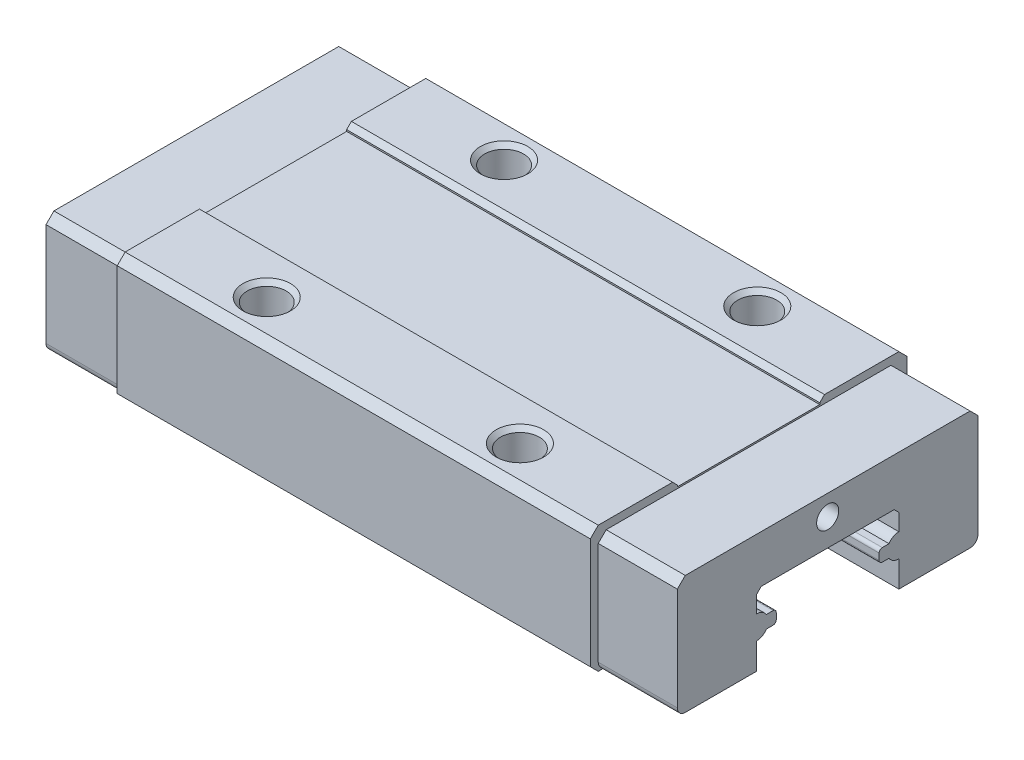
ISO-10303-21;
HEADER;
FILE_DESCRIPTION(('STEP AP214'),'2;1');
FILE_NAME('part.step','',(''),(''),'','','');
FILE_SCHEMA(('AUTOMOTIVE_DESIGN { 1 0 10303 214 1 1 1 1 }'));
ENDSEC;
DATA;
#1=APPLICATION_CONTEXT('core data for automotive mechanical design processes');
#2=APPLICATION_PROTOCOL_DEFINITION('international standard','automotive_design',2000,#1);
#3=PRODUCT_CONTEXT('',#1,'mechanical');
#4=PRODUCT('Part','Part','',(#3));
#5=PRODUCT_RELATED_PRODUCT_CATEGORY('part','',(#4));
#6=PRODUCT_DEFINITION_FORMATION('','',#4);
#7=PRODUCT_DEFINITION_CONTEXT('part definition',#1,'design');
#8=PRODUCT_DEFINITION('design','',#6,#7);
#9=PRODUCT_DEFINITION_SHAPE('','',#8);
#10=(LENGTH_UNIT() NAMED_UNIT(*) SI_UNIT(.MILLI.,.METRE.));
#11=(NAMED_UNIT(*) PLANE_ANGLE_UNIT() SI_UNIT($,.RADIAN.));
#12=(NAMED_UNIT(*) SI_UNIT($,.STERADIAN.) SOLID_ANGLE_UNIT());
#13=UNCERTAINTY_MEASURE_WITH_UNIT(LENGTH_MEASURE(1.E-05),#10,'distance_accuracy_value','');
#14=(GEOMETRIC_REPRESENTATION_CONTEXT(3) GLOBAL_UNCERTAINTY_ASSIGNED_CONTEXT((#13)) GLOBAL_UNIT_ASSIGNED_CONTEXT((#10,
#11,#12)) REPRESENTATION_CONTEXT('',''));
#15=CARTESIAN_POINT('',(0.,0.,0.));
#16=DIRECTION('',(0.,0.,1.));
#17=DIRECTION('',(1.,0.,0.));
#18=AXIS2_PLACEMENT_3D('',#15,#16,#17);
#19=CARTESIAN_POINT('',(11.95,8.,7.5));
#20=DIRECTION('',(0.,1.,0.));
#21=DIRECTION('',(0.,0.,1.));
#22=AXIS2_PLACEMENT_3D('',#19,#20,#21);
#23=CONICAL_SURFACE('',#22,1.5,0.7853981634);
#24=CARTESIAN_POINT('',(11.95,8.,7.5));
#25=DIRECTION('',(0.,-1.,0.));
#26=DIRECTION('',(0.,0.,-1.));
#27=AXIS2_PLACEMENT_3D('',#24,#25,#26);
#28=CIRCLE('',#27,1.5);
#29=CARTESIAN_POINT('',(11.95,8.,6.));
#30=VERTEX_POINT('',#29);
#31=EDGE_CURVE('E39',#30,#30,#28,.T.);
#32=ORIENTED_EDGE('',*,*,#31,.F.);
#33=EDGE_LOOP('',(#32));
#34=FACE_BOUND('',#33,.T.);
#35=CARTESIAN_POINT('',(11.95,7.7295,7.5));
#36=DIRECTION('',(0.,-1.,0.));
#37=DIRECTION('',(0.,0.,-1.));
#38=AXIS2_PLACEMENT_3D('',#35,#36,#37);
#39=CIRCLE('',#38,1.2295);
#40=CARTESIAN_POINT('',(11.95,7.7295,6.2705));
#41=VERTEX_POINT('',#40);
#42=EDGE_CURVE('E10',#41,#41,#39,.T.);
#43=ORIENTED_EDGE('',*,*,#42,.T.);
#44=EDGE_LOOP('',(#43));
#45=FACE_BOUND('',#44,.T.);
#46=ADVANCED_FACE('F16',(#34,#45),#23,.F.);
#47=CARTESIAN_POINT('',(11.95,5.,7.5));
#48=DIRECTION('',(0.,1.,0.));
#49=DIRECTION('',(0.,0.,-1.));
#50=AXIS2_PLACEMENT_3D('',#47,#48,#49);
#51=CYLINDRICAL_SURFACE('',#50,1.2295);
#52=ORIENTED_EDGE('',*,*,#42,.F.);
#53=EDGE_LOOP('',(#52));
#54=FACE_BOUND('',#53,.T.);
#55=CARTESIAN_POINT('',(11.95,5.,7.5));
#56=DIRECTION('',(0.,-1.,0.));
#57=DIRECTION('',(0.,0.,-1.));
#58=AXIS2_PLACEMENT_3D('',#55,#56,#57);
#59=CIRCLE('',#58,1.2295);
#60=CARTESIAN_POINT('',(11.95,5.,6.2705));
#61=VERTEX_POINT('',#60);
#62=EDGE_CURVE('E27',#61,#61,#59,.T.);
#63=ORIENTED_EDGE('',*,*,#62,.T.);
#64=EDGE_LOOP('',(#63));
#65=FACE_BOUND('',#64,.T.);
#66=ADVANCED_FACE('F1617',(#54,#65),#51,.F.);
#67=CARTESIAN_POINT('',(74.8,7.,9.5));
#68=DIRECTION('',(0.,0.,-1.));
#69=DIRECTION('',(0.,-1.,0.));
#70=AXIS2_PLACEMENT_3D('',#67,#68,#69);
#71=PLANE('',#70);
#72=DIRECTION('',(0.,1.,0.));
#73=VECTOR('',#72,1.);
#74=CARTESIAN_POINT('',(39.9,2.4,9.5));
#75=LINE('',#74,#73);
#76=CARTESIAN_POINT('',(39.9,0.5,9.5));
#77=VERTEX_POINT('',#76);
#78=CARTESIAN_POINT('',(39.9,7.,9.5));
#79=VERTEX_POINT('',#78);
#80=EDGE_CURVE('E768',#77,#79,#75,.T.);
#81=ORIENTED_EDGE('',*,*,#80,.T.);
#82=DIRECTION('',(-1.,0.,0.));
#83=VECTOR('',#82,1.);
#84=CARTESIAN_POINT('',(74.8,7.,9.5));
#85=LINE('',#84,#83);
#86=CARTESIAN_POINT('',(34.9,7.,9.5));
#87=VERTEX_POINT('',#86);
#88=EDGE_CURVE('E764',#79,#87,#85,.T.);
#89=ORIENTED_EDGE('',*,*,#88,.T.);
#90=DIRECTION('',(0.,-1.,0.));
#91=VECTOR('',#90,1.);
#92=CARTESIAN_POINT('',(34.9,7.,9.5));
#93=LINE('',#92,#91);
#94=CARTESIAN_POINT('',(34.9,0.5,9.5));
#95=VERTEX_POINT('',#94);
#96=EDGE_CURVE('E769',#87,#95,#93,.T.);
#97=ORIENTED_EDGE('',*,*,#96,.T.);
#98=DIRECTION('',(-1.,0.,0.));
#99=VECTOR('',#98,1.);
#100=CARTESIAN_POINT('',(74.8,0.5,9.5));
#101=LINE('',#100,#99);
#102=EDGE_CURVE('E686',#77,#95,#101,.T.);
#103=ORIENTED_EDGE('',*,*,#102,.F.);
#104=EDGE_LOOP('',(#81,#89,#97,#103));
#105=FACE_BOUND('',#104,.T.);
#106=ADVANCED_FACE('F1660',(#105),#71,.F.);
#107=CARTESIAN_POINT('',(39.9,8.,-9.5));
#108=DIRECTION('',(0.,-1.,0.));
#109=DIRECTION('',(0.,0.,-1.));
#110=AXIS2_PLACEMENT_3D('',#107,#108,#109);
#111=PLANE('',#110);
#112=DIRECTION('',(-1.,0.,0.));
#113=VECTOR('',#112,1.);
#114=CARTESIAN_POINT('',(39.9,8.,4.8));
#115=LINE('',#114,#113);
#116=CARTESIAN_POINT('',(34.9,8.,4.8));
#117=VERTEX_POINT('',#116);
#118=CARTESIAN_POINT('',(5.,8.,4.8));
#119=VERTEX_POINT('',#118);
#120=EDGE_CURVE('E915',#117,#119,#115,.T.);
#121=ORIENTED_EDGE('',*,*,#120,.T.);
#122=DIRECTION('',(0.,0.,1.));
#123=VECTOR('',#122,1.);
#124=CARTESIAN_POINT('',(5.,8.,-10.));
#125=LINE('',#124,#123);
#126=CARTESIAN_POINT('',(5.,8.,9.5));
#127=VERTEX_POINT('',#126);
#128=EDGE_CURVE('E1072',#119,#127,#125,.T.);
#129=ORIENTED_EDGE('',*,*,#128,.T.);
#130=DIRECTION('',(-1.,0.,0.));
#131=VECTOR('',#130,1.);
#132=CARTESIAN_POINT('',(39.9,8.,9.5));
#133=LINE('',#132,#131);
#134=CARTESIAN_POINT('',(34.9,8.,9.5));
#135=VERTEX_POINT('',#134);
#136=EDGE_CURVE('E903',#135,#127,#133,.T.);
#137=ORIENTED_EDGE('',*,*,#136,.F.);
#138=DIRECTION('',(0.,0.,1.));
#139=VECTOR('',#138,1.);
#140=CARTESIAN_POINT('',(34.9,8.,-10.));
#141=LINE('',#140,#139);
#142=EDGE_CURVE('E838',#117,#135,#141,.T.);
#143=ORIENTED_EDGE('',*,*,#142,.F.);
#144=EDGE_LOOP('',(#121,#129,#137,#143));
#145=FACE_BOUND('',#144,.T.);
#146=ORIENTED_EDGE('',*,*,#31,.T.);
#147=EDGE_LOOP('',(#146));
#148=FACE_BOUND('',#147,.T.);
#149=CARTESIAN_POINT('',(27.95,8.,7.5));
#150=DIRECTION('',(0.,-1.,0.));
#151=DIRECTION('',(0.,0.,-1.));
#152=AXIS2_PLACEMENT_3D('',#149,#150,#151);
#153=CIRCLE('',#152,1.5);
#154=CARTESIAN_POINT('',(27.95,8.,6.));
#155=VERTEX_POINT('',#154);
#156=EDGE_CURVE('E817',#155,#155,#153,.T.);
#157=ORIENTED_EDGE('',*,*,#156,.T.);
#158=EDGE_LOOP('',(#157));
#159=FACE_BOUND('',#158,.T.);
#160=ADVANCED_FACE('F1155',(#145,#148,#159),#111,.F.);
#161=CARTESIAN_POINT('',(39.9,8.,-9.5));
#162=DIRECTION('',(0.,-1.,0.));
#163=DIRECTION('',(0.,0.,-1.));
#164=AXIS2_PLACEMENT_3D('',#161,#162,#163);
#165=PLANE('',#164);
#166=DIRECTION('',(-1.,0.,0.));
#167=VECTOR('',#166,1.);
#168=CARTESIAN_POINT('',(39.9,8.,-4.8));
#169=LINE('',#168,#167);
#170=CARTESIAN_POINT('',(34.9,8.,-4.8));
#171=VERTEX_POINT('',#170);
#172=CARTESIAN_POINT('',(5.,8.,-4.8));
#173=VERTEX_POINT('',#172);
#174=EDGE_CURVE('E602',#171,#173,#169,.T.);
#175=ORIENTED_EDGE('',*,*,#174,.F.);
#176=DIRECTION('',(0.,0.,1.));
#177=VECTOR('',#176,1.);
#178=CARTESIAN_POINT('',(34.9,8.,-10.));
#179=LINE('',#178,#177);
#180=CARTESIAN_POINT('',(34.9,8.,-9.5));
#181=VERTEX_POINT('',#180);
#182=EDGE_CURVE('E670',#181,#171,#179,.T.);
#183=ORIENTED_EDGE('',*,*,#182,.F.);
#184=DIRECTION('',(-1.,0.,0.));
#185=VECTOR('',#184,1.);
#186=CARTESIAN_POINT('',(39.9,8.,-9.5));
#187=LINE('',#186,#185);
#188=CARTESIAN_POINT('',(5.,8.,-9.5));
#189=VERTEX_POINT('',#188);
#190=EDGE_CURVE('E658',#181,#189,#187,.T.);
#191=ORIENTED_EDGE('',*,*,#190,.T.);
#192=DIRECTION('',(0.,0.,1.));
#193=VECTOR('',#192,1.);
#194=CARTESIAN_POINT('',(5.,8.,-10.));
#195=LINE('',#194,#193);
#196=EDGE_CURVE('E578',#189,#173,#195,.T.);
#197=ORIENTED_EDGE('',*,*,#196,.T.);
#198=EDGE_LOOP('',(#175,#183,#191,#197));
#199=FACE_BOUND('',#198,.T.);
#200=CARTESIAN_POINT('',(11.95,8.,-7.5));
#201=DIRECTION('',(0.,-1.,0.));
#202=DIRECTION('',(0.,0.,-1.));
#203=AXIS2_PLACEMENT_3D('',#200,#201,#202);
#204=CIRCLE('',#203,1.5);
#205=CARTESIAN_POINT('',(11.95,8.,-9.));
#206=VERTEX_POINT('',#205);
#207=EDGE_CURVE('E574',#206,#206,#204,.T.);
#208=ORIENTED_EDGE('',*,*,#207,.T.);
#209=EDGE_LOOP('',(#208));
#210=FACE_BOUND('',#209,.T.);
#211=CARTESIAN_POINT('',(27.95,8.,-7.5));
#212=DIRECTION('',(0.,-1.,0.));
#213=DIRECTION('',(0.,0.,-1.));
#214=AXIS2_PLACEMENT_3D('',#211,#212,#213);
#215=CIRCLE('',#214,1.5);
#216=CARTESIAN_POINT('',(27.95,8.,-9.));
#217=VERTEX_POINT('',#216);
#218=EDGE_CURVE('E579',#217,#217,#215,.T.);
#219=ORIENTED_EDGE('',*,*,#218,.T.);
#220=EDGE_LOOP('',(#219));
#221=FACE_BOUND('',#220,.T.);
#222=ADVANCED_FACE('F1189',(#199,#210,#221),#165,.F.);
#223=CARTESIAN_POINT('',(39.9,7.5,-10.));
#224=DIRECTION('',(0.,-0.707106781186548,0.707106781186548));
#225=DIRECTION('',(-1.,0.,0.));
#226=AXIS2_PLACEMENT_3D('',#223,#224,#225);
#227=PLANE('',#226);
#228=DIRECTION('',(0.,0.707106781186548,0.707106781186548));
#229=VECTOR('',#228,1.);
#230=CARTESIAN_POINT('',(34.9,7.5,-10.));
#231=LINE('',#230,#229);
#232=CARTESIAN_POINT('',(34.9,7.5,-10.));
#233=VERTEX_POINT('',#232);
#234=EDGE_CURVE('E665',#233,#181,#231,.T.);
#235=ORIENTED_EDGE('',*,*,#234,.F.);
#236=DIRECTION('',(-1.,0.,0.));
#237=VECTOR('',#236,1.);
#238=CARTESIAN_POINT('',(39.9,7.5,-10.));
#239=LINE('',#238,#237);
#240=CARTESIAN_POINT('',(5.,7.5,-10.));
#241=VERTEX_POINT('',#240);
#242=EDGE_CURVE('E663',#233,#241,#239,.T.);
#243=ORIENTED_EDGE('',*,*,#242,.T.);
#244=DIRECTION('',(0.,0.707106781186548,0.707106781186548));
#245=VECTOR('',#244,1.);
#246=CARTESIAN_POINT('',(5.,7.5,-10.));
#247=LINE('',#246,#245);
#248=EDGE_CURVE('E659',#241,#189,#247,.T.);
#249=ORIENTED_EDGE('',*,*,#248,.T.);
#250=ORIENTED_EDGE('',*,*,#190,.F.);
#251=EDGE_LOOP('',(#235,#243,#249,#250));
#252=FACE_BOUND('',#251,.T.);
#253=ADVANCED_FACE('F1194',(#252),#227,.F.);
#254=CARTESIAN_POINT('',(39.9,0.5,-10.));
#255=DIRECTION('',(0.,0.,1.));
#256=DIRECTION('',(1.,0.,0.));
#257=AXIS2_PLACEMENT_3D('',#254,#255,#256);
#258=PLANE('',#257);
#259=DIRECTION('',(0.,1.,0.));
#260=VECTOR('',#259,1.);
#261=CARTESIAN_POINT('',(34.9,-1.,-10.));
#262=LINE('',#261,#260);
#263=CARTESIAN_POINT('',(34.9,0.5,-10.));
#264=VERTEX_POINT('',#263);
#265=EDGE_CURVE('E669',#264,#233,#262,.T.);
#266=ORIENTED_EDGE('',*,*,#265,.F.);
#267=DIRECTION('',(-1.,0.,0.));
#268=VECTOR('',#267,1.);
#269=CARTESIAN_POINT('',(39.9,0.5,-10.));
#270=LINE('',#269,#268);
#271=CARTESIAN_POINT('',(5.,0.5,-10.));
#272=VERTEX_POINT('',#271);
#273=EDGE_CURVE('E664',#264,#272,#270,.T.);
#274=ORIENTED_EDGE('',*,*,#273,.T.);
#275=DIRECTION('',(0.,1.,0.));
#276=VECTOR('',#275,1.);
#277=CARTESIAN_POINT('',(5.,-1.,-10.));
#278=LINE('',#277,#276);
#279=EDGE_CURVE('E1043',#272,#241,#278,.T.);
#280=ORIENTED_EDGE('',*,*,#279,.T.);
#281=ORIENTED_EDGE('',*,*,#242,.F.);
#282=EDGE_LOOP('',(#266,#274,#280,#281));
#283=FACE_BOUND('',#282,.T.);
#284=ADVANCED_FACE('F1196',(#283),#258,.F.);
#285=CARTESIAN_POINT('',(39.9,0.,-9.5));
#286=DIRECTION('',(0.,0.707106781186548,0.707106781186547));
#287=DIRECTION('',(1.,0.,0.));
#288=AXIS2_PLACEMENT_3D('',#285,#286,#287);
#289=PLANE('',#288);
#290=DIRECTION('',(0.,0.707106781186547,-0.707106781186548));
#291=VECTOR('',#290,1.);
#292=CARTESIAN_POINT('',(34.9,0.,-9.5));
#293=LINE('',#292,#291);
#294=CARTESIAN_POINT('',(34.9,0.,-9.5));
#295=VERTEX_POINT('',#294);
#296=EDGE_CURVE('E699',#295,#264,#293,.T.);
#297=ORIENTED_EDGE('',*,*,#296,.F.);
#298=DIRECTION('',(-1.,0.,0.));
#299=VECTOR('',#298,1.);
#300=CARTESIAN_POINT('',(39.9,0.,-9.5));
#301=LINE('',#300,#299);
#302=CARTESIAN_POINT('',(5.,0.,-9.5));
#303=VERTEX_POINT('',#302);
#304=EDGE_CURVE('E798',#295,#303,#301,.T.);
#305=ORIENTED_EDGE('',*,*,#304,.T.);
#306=DIRECTION('',(0.,0.707106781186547,-0.707106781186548));
#307=VECTOR('',#306,1.);
#308=CARTESIAN_POINT('',(5.,0.,-9.5));
#309=LINE('',#308,#307);
#310=EDGE_CURVE('E794',#303,#272,#309,.T.);
#311=ORIENTED_EDGE('',*,*,#310,.T.);
#312=ORIENTED_EDGE('',*,*,#273,.F.);
#313=EDGE_LOOP('',(#297,#305,#311,#312));
#314=FACE_BOUND('',#313,.T.);
#315=ADVANCED_FACE('F1199',(#314),#289,.F.);
#316=CARTESIAN_POINT('',(39.9,0.,-4.5));
#317=DIRECTION('',(0.,1.,0.));
#318=DIRECTION('',(1.,0.,0.));
#319=AXIS2_PLACEMENT_3D('',#316,#317,#318);
#320=PLANE('',#319);
#321=DIRECTION('',(-1.,0.,0.));
#322=VECTOR('',#321,1.);
#323=CARTESIAN_POINT('',(39.9,0.,-4.5));
#324=LINE('',#323,#322);
#325=CARTESIAN_POINT('',(39.9,0.,-4.5));
#326=VERTEX_POINT('',#325);
#327=CARTESIAN_POINT('',(0.,0.,-4.5));
#328=VERTEX_POINT('',#327);
#329=EDGE_CURVE('E799',#326,#328,#324,.T.);
#330=ORIENTED_EDGE('',*,*,#329,.T.);
#331=DIRECTION('',(0.,0.,-1.));
#332=VECTOR('',#331,1.);
#333=CARTESIAN_POINT('',(0.,0.,-4.5));
#334=LINE('',#333,#332);
#335=CARTESIAN_POINT('',(0.,0.,-9.));
#336=VERTEX_POINT('',#335);
#337=EDGE_CURVE('E788',#328,#336,#334,.T.);
#338=ORIENTED_EDGE('',*,*,#337,.T.);
#339=DIRECTION('',(1.,0.,0.));
#340=VECTOR('',#339,1.);
#341=CARTESIAN_POINT('',(-34.9,0.,-9.));
#342=LINE('',#341,#340);
#343=CARTESIAN_POINT('',(5.,0.,-9.));
#344=VERTEX_POINT('',#343);
#345=EDGE_CURVE('E653',#336,#344,#342,.T.);
#346=ORIENTED_EDGE('',*,*,#345,.T.);
#347=DIRECTION('',(0.,0.,-1.));
#348=VECTOR('',#347,1.);
#349=CARTESIAN_POINT('',(5.,0.,-4.5));
#350=LINE('',#349,#348);
#351=EDGE_CURVE('E649',#344,#303,#350,.T.);
#352=ORIENTED_EDGE('',*,*,#351,.T.);
#353=ORIENTED_EDGE('',*,*,#304,.F.);
#354=DIRECTION('',(0.,0.,-1.));
#355=VECTOR('',#354,1.);
#356=CARTESIAN_POINT('',(34.9,0.,-4.5));
#357=LINE('',#356,#355);
#358=CARTESIAN_POINT('',(34.9,0.,-9.));
#359=VERTEX_POINT('',#358);
#360=EDGE_CURVE('E620',#359,#295,#357,.T.);
#361=ORIENTED_EDGE('',*,*,#360,.F.);
#362=DIRECTION('',(-1.,0.,0.));
#363=VECTOR('',#362,1.);
#364=CARTESIAN_POINT('',(74.8,0.,-9.));
#365=LINE('',#364,#363);
#366=CARTESIAN_POINT('',(39.9,0.,-9.));
#367=VERTEX_POINT('',#366);
#368=EDGE_CURVE('E916',#367,#359,#365,.T.);
#369=ORIENTED_EDGE('',*,*,#368,.F.);
#370=DIRECTION('',(0.,0.,-1.));
#371=VECTOR('',#370,1.);
#372=CARTESIAN_POINT('',(39.9,0.,-4.5));
#373=LINE('',#372,#371);
#374=EDGE_CURVE('E789',#326,#367,#373,.T.);
#375=ORIENTED_EDGE('',*,*,#374,.F.);
#376=EDGE_LOOP('',(#330,#338,#346,#352,#353,#361,#369,#375));
#377=FACE_BOUND('',#376,.T.);
#378=ADVANCED_FACE('F1204',(#377),#320,.F.);
#379=CARTESIAN_POINT('',(39.9,1.65795889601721,-4.5));
#380=DIRECTION('',(0.,0.,-1.));
#381=DIRECTION('',(0.,-1.,0.));
#382=AXIS2_PLACEMENT_3D('',#379,#380,#381);
#383=PLANE('',#382);
#384=DIRECTION('',(0.,-1.,0.));
#385=VECTOR('',#384,1.);
#386=CARTESIAN_POINT('',(0.,1.65795889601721,-4.5));
#387=LINE('',#386,#385);
#388=CARTESIAN_POINT('',(0.,1.65795889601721,-4.5));
#389=VERTEX_POINT('',#388);
#390=EDGE_CURVE('E654',#389,#328,#387,.T.);
#391=ORIENTED_EDGE('',*,*,#390,.T.);
#392=ORIENTED_EDGE('',*,*,#329,.F.);
#393=DIRECTION('',(0.,-1.,0.));
#394=VECTOR('',#393,1.);
#395=CARTESIAN_POINT('',(39.9,1.65795889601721,-4.5));
#396=LINE('',#395,#394);
#397=CARTESIAN_POINT('',(39.9,1.65795889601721,-4.5));
#398=VERTEX_POINT('',#397);
#399=EDGE_CURVE('E568',#398,#326,#396,.T.);
#400=ORIENTED_EDGE('',*,*,#399,.F.);
#401=DIRECTION('',(-1.,0.,0.));
#402=VECTOR('',#401,1.);
#403=CARTESIAN_POINT('',(39.9,1.65795889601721,-4.5));
#404=LINE('',#403,#402);
#405=EDGE_CURVE('E631',#398,#389,#404,.T.);
#406=ORIENTED_EDGE('',*,*,#405,.T.);
#407=EDGE_LOOP('',(#391,#392,#400,#406));
#408=FACE_BOUND('',#407,.T.);
#409=ADVANCED_FACE('F1408',(#408),#383,.F.);
#410=CARTESIAN_POINT('',(39.9,2.4,-4.5));
#411=DIRECTION('',(1.,0.,0.));
#412=DIRECTION('',(0.,0.,1.));
#413=AXIS2_PLACEMENT_3D('',#410,#411,#412);
#414=CYLINDRICAL_SURFACE('',#413,0.742041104);
#415=CARTESIAN_POINT('',(0.,2.4,-4.5));
#416=DIRECTION('',(1.,0.,0.));
#417=DIRECTION('',(0.,0.,-1.));
#418=AXIS2_PLACEMENT_3D('',#415,#416,#417);
#419=CIRCLE('',#418,0.742041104);
#420=CARTESIAN_POINT('',(0.,2.,-3.875));
#421=VERTEX_POINT('',#420);
#422=EDGE_CURVE('E627',#421,#389,#419,.T.);
#423=ORIENTED_EDGE('',*,*,#422,.T.);
#424=ORIENTED_EDGE('',*,*,#405,.F.);
#425=CARTESIAN_POINT('',(39.9,2.4,-4.5));
#426=DIRECTION('',(1.,0.,0.));
#427=DIRECTION('',(0.,0.,-1.));
#428=AXIS2_PLACEMENT_3D('',#425,#426,#427);
#429=CIRCLE('',#428,0.742041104);
#430=CARTESIAN_POINT('',(39.9,2.,-3.875));
#431=VERTEX_POINT('',#430);
#432=EDGE_CURVE('E563',#431,#398,#429,.T.);
#433=ORIENTED_EDGE('',*,*,#432,.F.);
#434=DIRECTION('',(-1.,0.,0.));
#435=VECTOR('',#434,1.);
#436=CARTESIAN_POINT('',(39.9,2.,-3.875));
#437=LINE('',#436,#435);
#438=EDGE_CURVE('E632',#431,#421,#437,.T.);
#439=ORIENTED_EDGE('',*,*,#438,.T.);
#440=EDGE_LOOP('',(#423,#424,#433,#439));
#441=FACE_BOUND('',#440,.T.);
#442=ADVANCED_FACE('F1294',(#441),#414,.T.);
#443=CARTESIAN_POINT('',(39.9,2.,-3.45));
#444=DIRECTION('',(0.,1.,0.));
#445=DIRECTION('',(1.,0.,0.));
#446=AXIS2_PLACEMENT_3D('',#443,#444,#445);
#447=PLANE('',#446);
#448=DIRECTION('',(0.,0.,-1.));
#449=VECTOR('',#448,1.);
#450=CARTESIAN_POINT('',(0.,2.,-3.45));
#451=LINE('',#450,#449);
#452=CARTESIAN_POINT('',(0.,2.,-3.45));
#453=VERTEX_POINT('',#452);
#454=EDGE_CURVE('E633',#453,#421,#451,.T.);
#455=ORIENTED_EDGE('',*,*,#454,.T.);
#456=ORIENTED_EDGE('',*,*,#438,.F.);
#457=DIRECTION('',(0.,0.,-1.));
#458=VECTOR('',#457,1.);
#459=CARTESIAN_POINT('',(39.9,2.,-3.45));
#460=LINE('',#459,#458);
#461=CARTESIAN_POINT('',(39.9,2.,-3.45));
#462=VERTEX_POINT('',#461);
#463=EDGE_CURVE('E567',#462,#431,#460,.T.);
#464=ORIENTED_EDGE('',*,*,#463,.F.);
#465=DIRECTION('',(-1.,0.,0.));
#466=VECTOR('',#465,1.);
#467=CARTESIAN_POINT('',(39.9,2.,-3.45));
#468=LINE('',#467,#466);
#469=EDGE_CURVE('E637',#462,#453,#468,.T.);
#470=ORIENTED_EDGE('',*,*,#469,.T.);
#471=EDGE_LOOP('',(#455,#456,#464,#470));
#472=FACE_BOUND('',#471,.T.);
#473=ADVANCED_FACE('F1289',(#472),#447,.F.);
#474=CARTESIAN_POINT('',(39.9,2.2,-3.45));
#475=DIRECTION('',(1.,0.,0.));
#476=DIRECTION('',(0.,0.,1.));
#477=AXIS2_PLACEMENT_3D('',#474,#475,#476);
#478=CYLINDRICAL_SURFACE('',#477,0.2);
#479=CARTESIAN_POINT('',(0.,2.2,-3.45));
#480=DIRECTION('',(1.,0.,0.));
#481=DIRECTION('',(0.,0.,-1.));
#482=AXIS2_PLACEMENT_3D('',#479,#480,#481);
#483=CIRCLE('',#482,0.2);
#484=CARTESIAN_POINT('',(0.,2.2,-3.25));
#485=VERTEX_POINT('',#484);
#486=EDGE_CURVE('E1101',#485,#453,#483,.T.);
#487=ORIENTED_EDGE('',*,*,#486,.T.);
#488=ORIENTED_EDGE('',*,*,#469,.F.);
#489=CARTESIAN_POINT('',(39.9,2.2,-3.45));
#490=DIRECTION('',(1.,0.,0.));
#491=DIRECTION('',(0.,0.,-1.));
#492=AXIS2_PLACEMENT_3D('',#489,#490,#491);
#493=CIRCLE('',#492,0.2);
#494=CARTESIAN_POINT('',(39.9,2.2,-3.25));
#495=VERTEX_POINT('',#494);
#496=EDGE_CURVE('E596',#495,#462,#493,.T.);
#497=ORIENTED_EDGE('',*,*,#496,.F.);
#498=DIRECTION('',(-1.,0.,0.));
#499=VECTOR('',#498,1.);
#500=CARTESIAN_POINT('',(39.9,2.2,-3.25));
#501=LINE('',#500,#499);
#502=EDGE_CURVE('E1047',#495,#485,#501,.T.);
#503=ORIENTED_EDGE('',*,*,#502,.T.);
#504=EDGE_LOOP('',(#487,#488,#497,#503));
#505=FACE_BOUND('',#504,.T.);
#506=ADVANCED_FACE('F1293',(#505),#478,.T.);
#507=CARTESIAN_POINT('',(39.9,2.6,-3.25));
#508=DIRECTION('',(0.,0.,-1.));
#509=DIRECTION('',(0.,-1.,0.));
#510=AXIS2_PLACEMENT_3D('',#507,#508,#509);
#511=PLANE('',#510);
#512=DIRECTION('',(0.,-1.,0.));
#513=VECTOR('',#512,1.);
#514=CARTESIAN_POINT('',(0.,2.6,-3.25));
#515=LINE('',#514,#513);
#516=CARTESIAN_POINT('',(0.,2.6,-3.25));
#517=VERTEX_POINT('',#516);
#518=EDGE_CURVE('E641',#517,#485,#515,.T.);
#519=ORIENTED_EDGE('',*,*,#518,.T.);
#520=ORIENTED_EDGE('',*,*,#502,.F.);
#521=DIRECTION('',(0.,-1.,0.));
#522=VECTOR('',#521,1.);
#523=CARTESIAN_POINT('',(39.9,2.6,-3.25));
#524=LINE('',#523,#522);
#525=CARTESIAN_POINT('',(39.9,2.6,-3.25));
#526=VERTEX_POINT('',#525);
#527=EDGE_CURVE('E591',#526,#495,#524,.T.);
#528=ORIENTED_EDGE('',*,*,#527,.F.);
#529=DIRECTION('',(-1.,0.,0.));
#530=VECTOR('',#529,1.);
#531=CARTESIAN_POINT('',(39.9,2.6,-3.25));
#532=LINE('',#531,#530);
#533=EDGE_CURVE('E638',#526,#517,#532,.T.);
#534=ORIENTED_EDGE('',*,*,#533,.T.);
#535=EDGE_LOOP('',(#519,#520,#528,#534));
#536=FACE_BOUND('',#535,.T.);
#537=ADVANCED_FACE('F1318',(#536),#511,.F.);
#538=CARTESIAN_POINT('',(39.9,2.6,-3.45));
#539=DIRECTION('',(1.,0.,0.));
#540=DIRECTION('',(0.,0.,1.));
#541=AXIS2_PLACEMENT_3D('',#538,#539,#540);
#542=CYLINDRICAL_SURFACE('',#541,0.2);
#543=CARTESIAN_POINT('',(0.,2.6,-3.45));
#544=DIRECTION('',(1.,0.,0.));
#545=DIRECTION('',(0.,0.,-1.));
#546=AXIS2_PLACEMENT_3D('',#543,#544,#545);
#547=CIRCLE('',#546,0.2);
#548=CARTESIAN_POINT('',(0.,2.8,-3.45));
#549=VERTEX_POINT('',#548);
#550=EDGE_CURVE('E642',#549,#517,#547,.T.);
#551=ORIENTED_EDGE('',*,*,#550,.T.);
#552=ORIENTED_EDGE('',*,*,#533,.F.);
#553=CARTESIAN_POINT('',(39.9,2.6,-3.45));
#554=DIRECTION('',(1.,0.,0.));
#555=DIRECTION('',(0.,0.,-1.));
#556=AXIS2_PLACEMENT_3D('',#553,#554,#555);
#557=CIRCLE('',#556,0.2);
#558=CARTESIAN_POINT('',(39.9,2.8,-3.45));
#559=VERTEX_POINT('',#558);
#560=EDGE_CURVE('E595',#559,#526,#557,.T.);
#561=ORIENTED_EDGE('',*,*,#560,.F.);
#562=DIRECTION('',(-1.,0.,0.));
#563=VECTOR('',#562,1.);
#564=CARTESIAN_POINT('',(39.9,2.8,-3.45));
#565=LINE('',#564,#563);
#566=EDGE_CURVE('E647',#559,#549,#565,.T.);
#567=ORIENTED_EDGE('',*,*,#566,.T.);
#568=EDGE_LOOP('',(#551,#552,#561,#567));
#569=FACE_BOUND('',#568,.T.);
#570=ADVANCED_FACE('F1322',(#569),#542,.T.);
#571=CARTESIAN_POINT('',(39.9,2.8,-3.875));
#572=DIRECTION('',(0.,-1.,0.));
#573=DIRECTION('',(0.,0.,-1.));
#574=AXIS2_PLACEMENT_3D('',#571,#572,#573);
#575=PLANE('',#574);
#576=DIRECTION('',(0.,0.,1.));
#577=VECTOR('',#576,1.);
#578=CARTESIAN_POINT('',(0.,2.8,-3.875));
#579=LINE('',#578,#577);
#580=CARTESIAN_POINT('',(0.,2.8,-3.875));
#581=VERTEX_POINT('',#580);
#582=EDGE_CURVE('E643',#581,#549,#579,.T.);
#583=ORIENTED_EDGE('',*,*,#582,.T.);
#584=ORIENTED_EDGE('',*,*,#566,.F.);
#585=DIRECTION('',(0.,0.,1.));
#586=VECTOR('',#585,1.);
#587=CARTESIAN_POINT('',(39.9,2.8,-3.875));
#588=LINE('',#587,#586);
#589=CARTESIAN_POINT('',(39.9,2.8,-3.875));
#590=VERTEX_POINT('',#589);
#591=EDGE_CURVE('E1901',#590,#559,#588,.T.);
#592=ORIENTED_EDGE('',*,*,#591,.F.);
#593=DIRECTION('',(-1.,0.,0.));
#594=VECTOR('',#593,1.);
#595=CARTESIAN_POINT('',(39.9,2.8,-3.875));
#596=LINE('',#595,#594);
#597=EDGE_CURVE('E648',#590,#581,#596,.T.);
#598=ORIENTED_EDGE('',*,*,#597,.T.);
#599=EDGE_LOOP('',(#583,#584,#592,#598));
#600=FACE_BOUND('',#599,.T.);
#601=ADVANCED_FACE('F1444',(#600),#575,.F.);
#602=CARTESIAN_POINT('',(39.9,2.4,-4.5));
#603=DIRECTION('',(1.,0.,0.));
#604=DIRECTION('',(0.,0.,1.));
#605=AXIS2_PLACEMENT_3D('',#602,#603,#604);
#606=CYLINDRICAL_SURFACE('',#605,0.742041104);
#607=CARTESIAN_POINT('',(0.,2.4,-4.5));
#608=DIRECTION('',(1.,0.,0.));
#609=DIRECTION('',(0.,0.,-1.));
#610=AXIS2_PLACEMENT_3D('',#607,#608,#609);
#611=CIRCLE('',#610,0.742041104);
#612=CARTESIAN_POINT('',(0.,3.14204110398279,-4.5));
#613=VERTEX_POINT('',#612);
#614=EDGE_CURVE('E947',#613,#581,#611,.T.);
#615=ORIENTED_EDGE('',*,*,#614,.T.);
#616=ORIENTED_EDGE('',*,*,#597,.F.);
#617=CARTESIAN_POINT('',(39.9,2.4,-4.5));
#618=DIRECTION('',(1.,0.,0.));
#619=DIRECTION('',(0.,0.,-1.));
#620=AXIS2_PLACEMENT_3D('',#617,#618,#619);
#621=CIRCLE('',#620,0.742041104);
#622=CARTESIAN_POINT('',(39.9,3.14204110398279,-4.5));
#623=VERTEX_POINT('',#622);
#624=EDGE_CURVE('E1905',#623,#590,#621,.T.);
#625=ORIENTED_EDGE('',*,*,#624,.F.);
#626=DIRECTION('',(-1.,0.,0.));
#627=VECTOR('',#626,1.);
#628=CARTESIAN_POINT('',(39.9,3.14204110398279,-4.5));
#629=LINE('',#628,#627);
#630=EDGE_CURVE('E757',#623,#613,#629,.T.);
#631=ORIENTED_EDGE('',*,*,#630,.T.);
#632=EDGE_LOOP('',(#615,#616,#625,#631));
#633=FACE_BOUND('',#632,.T.);
#634=ADVANCED_FACE('F1555',(#633),#606,.T.);
#635=CARTESIAN_POINT('',(39.9,4.2,-4.5));
#636=DIRECTION('',(0.,0.,-1.));
#637=DIRECTION('',(0.,-1.,0.));
#638=AXIS2_PLACEMENT_3D('',#635,#636,#637);
#639=PLANE('',#638);
#640=DIRECTION('',(0.,-1.,0.));
#641=VECTOR('',#640,1.);
#642=CARTESIAN_POINT('',(0.,4.2,-4.5));
#643=LINE('',#642,#641);
#644=CARTESIAN_POINT('',(0.,4.2,-4.5));
#645=VERTEX_POINT('',#644);
#646=EDGE_CURVE('E753',#645,#613,#643,.T.);
#647=ORIENTED_EDGE('',*,*,#646,.T.);
#648=ORIENTED_EDGE('',*,*,#630,.F.);
#649=DIRECTION('',(0.,-1.,0.));
#650=VECTOR('',#649,1.);
#651=CARTESIAN_POINT('',(39.9,4.2,-4.5));
#652=LINE('',#651,#650);
#653=CARTESIAN_POINT('',(39.9,4.2,-4.5));
#654=VERTEX_POINT('',#653);
#655=EDGE_CURVE('E544',#654,#623,#652,.T.);
#656=ORIENTED_EDGE('',*,*,#655,.F.);
#657=DIRECTION('',(-1.,0.,0.));
#658=VECTOR('',#657,1.);
#659=CARTESIAN_POINT('',(39.9,4.2,-4.5));
#660=LINE('',#659,#658);
#661=EDGE_CURVE('E758',#654,#645,#660,.T.);
#662=ORIENTED_EDGE('',*,*,#661,.T.);
#663=EDGE_LOOP('',(#647,#648,#656,#662));
#664=FACE_BOUND('',#663,.T.);
#665=ADVANCED_FACE('F1501',(#664),#639,.F.);
#666=CARTESIAN_POINT('',(39.9,4.5,-4.2));
#667=DIRECTION('',(0.,0.707106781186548,-0.707106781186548));
#668=DIRECTION('',(-1.,0.,0.));
#669=AXIS2_PLACEMENT_3D('',#666,#667,#668);
#670=PLANE('',#669);
#671=DIRECTION('',(0.,-0.707106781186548,-0.707106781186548));
#672=VECTOR('',#671,1.);
#673=CARTESIAN_POINT('',(0.,4.5,-4.2));
#674=LINE('',#673,#672);
#675=CARTESIAN_POINT('',(0.,4.5,-4.2));
#676=VERTEX_POINT('',#675);
#677=EDGE_CURVE('E555',#676,#645,#674,.T.);
#678=ORIENTED_EDGE('',*,*,#677,.T.);
#679=ORIENTED_EDGE('',*,*,#661,.F.);
#680=DIRECTION('',(0.,-0.707106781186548,-0.707106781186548));
#681=VECTOR('',#680,1.);
#682=CARTESIAN_POINT('',(39.9,4.5,-4.2));
#683=LINE('',#682,#681);
#684=CARTESIAN_POINT('',(39.9,4.5,-4.2));
#685=VERTEX_POINT('',#684);
#686=EDGE_CURVE('E597',#685,#654,#683,.T.);
#687=ORIENTED_EDGE('',*,*,#686,.F.);
#688=DIRECTION('',(-1.,0.,0.));
#689=VECTOR('',#688,1.);
#690=CARTESIAN_POINT('',(39.9,4.5,-4.2));
#691=LINE('',#690,#689);
#692=EDGE_CURVE('E551',#685,#676,#691,.T.);
#693=ORIENTED_EDGE('',*,*,#692,.T.);
#694=EDGE_LOOP('',(#678,#679,#687,#693));
#695=FACE_BOUND('',#694,.T.);
#696=ADVANCED_FACE('F1497',(#695),#670,.F.);
#697=CARTESIAN_POINT('',(39.9,4.5,4.2));
#698=DIRECTION('',(0.,1.,0.));
#699=DIRECTION('',(1.,0.,0.));
#700=AXIS2_PLACEMENT_3D('',#697,#698,#699);
#701=PLANE('',#700);
#702=DIRECTION('',(0.,0.,-1.));
#703=VECTOR('',#702,1.);
#704=CARTESIAN_POINT('',(0.,4.5,4.2));
#705=LINE('',#704,#703);
#706=CARTESIAN_POINT('',(0.,4.5,4.2));
#707=VERTEX_POINT('',#706);
#708=EDGE_CURVE('E556',#707,#676,#705,.T.);
#709=ORIENTED_EDGE('',*,*,#708,.T.);
#710=ORIENTED_EDGE('',*,*,#692,.F.);
#711=DIRECTION('',(0.,0.,-1.));
#712=VECTOR('',#711,1.);
#713=CARTESIAN_POINT('',(39.9,4.5,4.2));
#714=LINE('',#713,#712);
#715=CARTESIAN_POINT('',(39.9,4.5,4.2));
#716=VERTEX_POINT('',#715);
#717=EDGE_CURVE('E601',#716,#685,#714,.T.);
#718=ORIENTED_EDGE('',*,*,#717,.F.);
#719=DIRECTION('',(-1.,0.,0.));
#720=VECTOR('',#719,1.);
#721=CARTESIAN_POINT('',(39.9,4.5,4.2));
#722=LINE('',#721,#720);
#723=EDGE_CURVE('E713',#716,#707,#722,.T.);
#724=ORIENTED_EDGE('',*,*,#723,.T.);
#725=EDGE_LOOP('',(#709,#710,#718,#724));
#726=FACE_BOUND('',#725,.T.);
#727=ADVANCED_FACE('F1282',(#726),#701,.F.);
#728=CARTESIAN_POINT('',(39.9,4.2,4.5));
#729=DIRECTION('',(0.,0.707106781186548,0.707106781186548));
#730=DIRECTION('',(1.,0.,0.));
#731=AXIS2_PLACEMENT_3D('',#728,#729,#730);
#732=PLANE('',#731);
#733=DIRECTION('',(0.,0.707106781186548,-0.707106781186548));
#734=VECTOR('',#733,1.);
#735=CARTESIAN_POINT('',(0.,4.2,4.5));
#736=LINE('',#735,#734);
#737=CARTESIAN_POINT('',(0.,4.2,4.5));
#738=VERTEX_POINT('',#737);
#739=EDGE_CURVE('E709',#738,#707,#736,.T.);
#740=ORIENTED_EDGE('',*,*,#739,.T.);
#741=ORIENTED_EDGE('',*,*,#723,.F.);
#742=DIRECTION('',(0.,0.707106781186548,-0.707106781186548));
#743=VECTOR('',#742,1.);
#744=CARTESIAN_POINT('',(39.9,4.2,4.5));
#745=LINE('',#744,#743);
#746=CARTESIAN_POINT('',(39.9,4.2,4.5));
#747=VERTEX_POINT('',#746);
#748=EDGE_CURVE('E708',#747,#716,#745,.T.);
#749=ORIENTED_EDGE('',*,*,#748,.F.);
#750=DIRECTION('',(-1.,0.,0.));
#751=VECTOR('',#750,1.);
#752=CARTESIAN_POINT('',(39.9,4.2,4.5));
#753=LINE('',#752,#751);
#754=EDGE_CURVE('E714',#747,#738,#753,.T.);
#755=ORIENTED_EDGE('',*,*,#754,.T.);
#756=EDGE_LOOP('',(#740,#741,#749,#755));
#757=FACE_BOUND('',#756,.T.);
#758=ADVANCED_FACE('F1277',(#757),#732,.F.);
#759=CARTESIAN_POINT('',(39.9,3.14204110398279,4.5));
#760=DIRECTION('',(0.,0.,1.));
#761=DIRECTION('',(1.,0.,0.));
#762=AXIS2_PLACEMENT_3D('',#759,#760,#761);
#763=PLANE('',#762);
#764=DIRECTION('',(0.,1.,0.));
#765=VECTOR('',#764,1.);
#766=CARTESIAN_POINT('',(0.,3.14204110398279,4.5));
#767=LINE('',#766,#765);
#768=CARTESIAN_POINT('',(0.,3.14204110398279,4.5));
#769=VERTEX_POINT('',#768);
#770=EDGE_CURVE('E907',#769,#738,#767,.T.);
#771=ORIENTED_EDGE('',*,*,#770,.T.);
#772=ORIENTED_EDGE('',*,*,#754,.F.);
#773=DIRECTION('',(0.,1.,0.));
#774=VECTOR('',#773,1.);
#775=CARTESIAN_POINT('',(39.9,3.14204110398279,4.5));
#776=LINE('',#775,#774);
#777=CARTESIAN_POINT('',(39.9,3.14204110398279,4.5));
#778=VERTEX_POINT('',#777);
#779=EDGE_CURVE('E806',#778,#747,#776,.T.);
#780=ORIENTED_EDGE('',*,*,#779,.F.);
#781=DIRECTION('',(-1.,0.,0.));
#782=VECTOR('',#781,1.);
#783=CARTESIAN_POINT('',(39.9,3.14204110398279,4.5));
#784=LINE('',#783,#782);
#785=EDGE_CURVE('E911',#778,#769,#784,.T.);
#786=ORIENTED_EDGE('',*,*,#785,.T.);
#787=EDGE_LOOP('',(#771,#772,#780,#786));
#788=FACE_BOUND('',#787,.T.);
#789=ADVANCED_FACE('F1281',(#788),#763,.F.);
#790=CARTESIAN_POINT('',(39.9,2.4,4.5));
#791=DIRECTION('',(1.,0.,0.));
#792=DIRECTION('',(0.,0.,1.));
#793=AXIS2_PLACEMENT_3D('',#790,#791,#792);
#794=CYLINDRICAL_SURFACE('',#793,0.742041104);
#795=CARTESIAN_POINT('',(0.,2.4,4.5));
#796=DIRECTION('',(1.,0.,0.));
#797=DIRECTION('',(0.,0.,-1.));
#798=AXIS2_PLACEMENT_3D('',#795,#796,#797);
#799=CIRCLE('',#798,0.742041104);
#800=CARTESIAN_POINT('',(0.,2.8,3.875));
#801=VERTEX_POINT('',#800);
#802=EDGE_CURVE('E674',#801,#769,#799,.T.);
#803=ORIENTED_EDGE('',*,*,#802,.T.);
#804=ORIENTED_EDGE('',*,*,#785,.F.);
#805=CARTESIAN_POINT('',(39.9,2.4,4.5));
#806=DIRECTION('',(1.,0.,0.));
#807=DIRECTION('',(0.,0.,-1.));
#808=AXIS2_PLACEMENT_3D('',#805,#806,#807);
#809=CIRCLE('',#808,0.742041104);
#810=CARTESIAN_POINT('',(39.9,2.8,3.875));
#811=VERTEX_POINT('',#810);
#812=EDGE_CURVE('E681',#811,#778,#809,.T.);
#813=ORIENTED_EDGE('',*,*,#812,.F.);
#814=DIRECTION('',(-1.,0.,0.));
#815=VECTOR('',#814,1.);
#816=CARTESIAN_POINT('',(39.9,2.8,3.875));
#817=LINE('',#816,#815);
#818=EDGE_CURVE('E671',#811,#801,#817,.T.);
#819=ORIENTED_EDGE('',*,*,#818,.T.);
#820=EDGE_LOOP('',(#803,#804,#813,#819));
#821=FACE_BOUND('',#820,.T.);
#822=ADVANCED_FACE('F1262',(#821),#794,.T.);
#823=CARTESIAN_POINT('',(39.9,2.8,3.45));
#824=DIRECTION('',(0.,-1.,0.));
#825=DIRECTION('',(0.,0.,-1.));
#826=AXIS2_PLACEMENT_3D('',#823,#824,#825);
#827=PLANE('',#826);
#828=DIRECTION('',(0.,0.,1.));
#829=VECTOR('',#828,1.);
#830=CARTESIAN_POINT('',(0.,2.8,3.45));
#831=LINE('',#830,#829);
#832=CARTESIAN_POINT('',(0.,2.8,3.45));
#833=VERTEX_POINT('',#832);
#834=EDGE_CURVE('E675',#833,#801,#831,.T.);
#835=ORIENTED_EDGE('',*,*,#834,.T.);
#836=ORIENTED_EDGE('',*,*,#818,.F.);
#837=DIRECTION('',(0.,0.,1.));
#838=VECTOR('',#837,1.);
#839=CARTESIAN_POINT('',(39.9,2.8,3.45));
#840=LINE('',#839,#838);
#841=CARTESIAN_POINT('',(39.9,2.8,3.45));
#842=VERTEX_POINT('',#841);
#843=EDGE_CURVE('E676',#842,#811,#840,.T.);
#844=ORIENTED_EDGE('',*,*,#843,.F.);
#845=DIRECTION('',(-1.,0.,0.));
#846=VECTOR('',#845,1.);
#847=CARTESIAN_POINT('',(39.9,2.8,3.45));
#848=LINE('',#847,#846);
#849=EDGE_CURVE('E882',#842,#833,#848,.T.);
#850=ORIENTED_EDGE('',*,*,#849,.T.);
#851=EDGE_LOOP('',(#835,#836,#844,#850));
#852=FACE_BOUND('',#851,.T.);
#853=ADVANCED_FACE('F1258',(#852),#827,.F.);
#854=CARTESIAN_POINT('',(39.9,2.6,3.45));
#855=DIRECTION('',(1.,0.,0.));
#856=DIRECTION('',(0.,0.,1.));
#857=AXIS2_PLACEMENT_3D('',#854,#855,#856);
#858=CYLINDRICAL_SURFACE('',#857,0.2);
#859=CARTESIAN_POINT('',(0.,2.6,3.45));
#860=DIRECTION('',(1.,0.,0.));
#861=DIRECTION('',(0.,0.,-1.));
#862=AXIS2_PLACEMENT_3D('',#859,#860,#861);
#863=CIRCLE('',#862,0.2);
#864=CARTESIAN_POINT('',(0.,2.6,3.25));
#865=VERTEX_POINT('',#864);
#866=EDGE_CURVE('E989',#865,#833,#863,.T.);
#867=ORIENTED_EDGE('',*,*,#866,.T.);
#868=ORIENTED_EDGE('',*,*,#849,.F.);
#869=CARTESIAN_POINT('',(39.9,2.6,3.45));
#870=DIRECTION('',(1.,0.,0.));
#871=DIRECTION('',(0.,0.,-1.));
#872=AXIS2_PLACEMENT_3D('',#869,#870,#871);
#873=CIRCLE('',#872,0.2);
#874=CARTESIAN_POINT('',(39.9,2.6,3.25));
#875=VERTEX_POINT('',#874);
#876=EDGE_CURVE('E680',#875,#842,#873,.T.);
#877=ORIENTED_EDGE('',*,*,#876,.F.);
#878=DIRECTION('',(-1.,0.,0.));
#879=VECTOR('',#878,1.);
#880=CARTESIAN_POINT('',(39.9,2.6,3.25));
#881=LINE('',#880,#879);
#882=EDGE_CURVE('E780',#875,#865,#881,.T.);
#883=ORIENTED_EDGE('',*,*,#882,.T.);
#884=EDGE_LOOP('',(#867,#868,#877,#883));
#885=FACE_BOUND('',#884,.T.);
#886=ADVANCED_FACE('F1243',(#885),#858,.T.);
#887=CARTESIAN_POINT('',(39.9,2.2,3.25));
#888=DIRECTION('',(0.,0.,1.));
#889=DIRECTION('',(1.,0.,0.));
#890=AXIS2_PLACEMENT_3D('',#887,#888,#889);
#891=PLANE('',#890);
#892=DIRECTION('',(0.,1.,0.));
#893=VECTOR('',#892,1.);
#894=CARTESIAN_POINT('',(0.,2.2,3.25));
#895=LINE('',#894,#893);
#896=CARTESIAN_POINT('',(0.,2.2,3.25));
#897=VERTEX_POINT('',#896);
#898=EDGE_CURVE('E776',#897,#865,#895,.T.);
#899=ORIENTED_EDGE('',*,*,#898,.T.);
#900=ORIENTED_EDGE('',*,*,#882,.F.);
#901=DIRECTION('',(0.,1.,0.));
#902=VECTOR('',#901,1.);
#903=CARTESIAN_POINT('',(39.9,2.2,3.25));
#904=LINE('',#903,#902);
#905=CARTESIAN_POINT('',(39.9,2.2,3.25));
#906=VERTEX_POINT('',#905);
#907=EDGE_CURVE('E685',#906,#875,#904,.T.);
#908=ORIENTED_EDGE('',*,*,#907,.F.);
#909=DIRECTION('',(-1.,0.,0.));
#910=VECTOR('',#909,1.);
#911=CARTESIAN_POINT('',(39.9,2.2,3.25));
#912=LINE('',#911,#910);
#913=EDGE_CURVE('E781',#906,#897,#912,.T.);
#914=ORIENTED_EDGE('',*,*,#913,.T.);
#915=EDGE_LOOP('',(#899,#900,#908,#914));
#916=FACE_BOUND('',#915,.T.);
#917=ADVANCED_FACE('F1238',(#916),#891,.F.);
#918=CARTESIAN_POINT('',(39.9,2.2,3.45));
#919=DIRECTION('',(1.,0.,0.));
#920=DIRECTION('',(0.,0.,1.));
#921=AXIS2_PLACEMENT_3D('',#918,#919,#920);
#922=CYLINDRICAL_SURFACE('',#921,0.2);
#923=CARTESIAN_POINT('',(0.,2.2,3.45));
#924=DIRECTION('',(1.,0.,0.));
#925=DIRECTION('',(0.,0.,-1.));
#926=AXIS2_PLACEMENT_3D('',#923,#924,#925);
#927=CIRCLE('',#926,0.2);
#928=CARTESIAN_POINT('',(0.,2.,3.45));
#929=VERTEX_POINT('',#928);
#930=EDGE_CURVE('E772',#929,#897,#927,.T.);
#931=ORIENTED_EDGE('',*,*,#930,.T.);
#932=ORIENTED_EDGE('',*,*,#913,.F.);
#933=CARTESIAN_POINT('',(39.9,2.2,3.45));
#934=DIRECTION('',(1.,0.,0.));
#935=DIRECTION('',(0.,0.,-1.));
#936=AXIS2_PLACEMENT_3D('',#933,#934,#935);
#937=CIRCLE('',#936,0.2);
#938=CARTESIAN_POINT('',(39.9,2.,3.45));
#939=VERTEX_POINT('',#938);
#940=EDGE_CURVE('E517',#939,#906,#937,.T.);
#941=ORIENTED_EDGE('',*,*,#940,.F.);
#942=DIRECTION('',(-1.,0.,0.));
#943=VECTOR('',#942,1.);
#944=CARTESIAN_POINT('',(39.9,2.,3.45));
#945=LINE('',#944,#943);
#946=EDGE_CURVE('E511',#939,#929,#945,.T.);
#947=ORIENTED_EDGE('',*,*,#946,.T.);
#948=EDGE_LOOP('',(#931,#932,#941,#947));
#949=FACE_BOUND('',#948,.T.);
#950=ADVANCED_FACE('F1242',(#949),#922,.T.);
#951=CARTESIAN_POINT('',(39.9,2.,3.875));
#952=DIRECTION('',(0.,1.,0.));
#953=DIRECTION('',(1.,0.,0.));
#954=AXIS2_PLACEMENT_3D('',#951,#952,#953);
#955=PLANE('',#954);
#956=DIRECTION('',(0.,0.,-1.));
#957=VECTOR('',#956,1.);
#958=CARTESIAN_POINT('',(0.,2.,3.875));
#959=LINE('',#958,#957);
#960=CARTESIAN_POINT('',(0.,2.,3.875));
#961=VERTEX_POINT('',#960);
#962=EDGE_CURVE('E526',#961,#929,#959,.T.);
#963=ORIENTED_EDGE('',*,*,#962,.T.);
#964=ORIENTED_EDGE('',*,*,#946,.F.);
#965=DIRECTION('',(0.,0.,-1.));
#966=VECTOR('',#965,1.);
#967=CARTESIAN_POINT('',(39.9,2.,3.875));
#968=LINE('',#967,#966);
#969=CARTESIAN_POINT('',(39.9,2.,3.875));
#970=VERTEX_POINT('',#969);
#971=EDGE_CURVE('E505',#970,#939,#968,.T.);
#972=ORIENTED_EDGE('',*,*,#971,.F.);
#973=DIRECTION('',(-1.,0.,0.));
#974=VECTOR('',#973,1.);
#975=CARTESIAN_POINT('',(39.9,2.,3.875));
#976=LINE('',#975,#974);
#977=EDGE_CURVE('E509',#970,#961,#976,.T.);
#978=ORIENTED_EDGE('',*,*,#977,.T.);
#979=EDGE_LOOP('',(#963,#964,#972,#978));
#980=FACE_BOUND('',#979,.T.);
#981=ADVANCED_FACE('F508',(#980),#955,.F.);
#982=CARTESIAN_POINT('',(39.9,2.4,4.5));
#983=DIRECTION('',(1.,0.,0.));
#984=DIRECTION('',(0.,0.,1.));
#985=AXIS2_PLACEMENT_3D('',#982,#983,#984);
#986=CYLINDRICAL_SURFACE('',#985,0.742041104);
#987=CARTESIAN_POINT('',(0.,2.4,4.5));
#988=DIRECTION('',(1.,0.,0.));
#989=DIRECTION('',(0.,0.,-1.));
#990=AXIS2_PLACEMENT_3D('',#987,#988,#989);
#991=CIRCLE('',#990,0.742041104);
#992=CARTESIAN_POINT('',(0.,1.65795889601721,4.5));
#993=VERTEX_POINT('',#992);
#994=EDGE_CURVE('E524',#993,#961,#991,.T.);
#995=ORIENTED_EDGE('',*,*,#994,.T.);
#996=ORIENTED_EDGE('',*,*,#977,.F.);
#997=CARTESIAN_POINT('',(39.9,2.4,4.5));
#998=DIRECTION('',(1.,0.,0.));
#999=DIRECTION('',(0.,0.,-1.));
#1000=AXIS2_PLACEMENT_3D('',#997,#998,#999);
#1001=CIRCLE('',#1000,0.742041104);
#1002=CARTESIAN_POINT('',(39.9,1.65795889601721,4.5));
#1003=VERTEX_POINT('',#1002);
#1004=EDGE_CURVE('E516',#1003,#970,#1001,.T.);
#1005=ORIENTED_EDGE('',*,*,#1004,.F.);
#1006=DIRECTION('',(-1.,0.,0.));
#1007=VECTOR('',#1006,1.);
#1008=CARTESIAN_POINT('',(39.9,1.65795889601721,4.5));
#1009=LINE('',#1008,#1007);
#1010=EDGE_CURVE('E695',#1003,#993,#1009,.T.);
#1011=ORIENTED_EDGE('',*,*,#1010,.T.);
#1012=EDGE_LOOP('',(#995,#996,#1005,#1011));
#1013=FACE_BOUND('',#1012,.T.);
#1014=ADVANCED_FACE('F521',(#1013),#986,.T.);
#1015=CARTESIAN_POINT('',(39.9,0.,4.5));
#1016=DIRECTION('',(0.,0.,1.));
#1017=DIRECTION('',(1.,0.,0.));
#1018=AXIS2_PLACEMENT_3D('',#1015,#1016,#1017);
#1019=PLANE('',#1018);
#1020=DIRECTION('',(0.,1.,0.));
#1021=VECTOR('',#1020,1.);
#1022=CARTESIAN_POINT('',(0.,0.,4.5));
#1023=LINE('',#1022,#1021);
#1024=CARTESIAN_POINT('',(0.,0.,4.5));
#1025=VERTEX_POINT('',#1024);
#1026=EDGE_CURVE('E850',#1025,#993,#1023,.T.);
#1027=ORIENTED_EDGE('',*,*,#1026,.T.);
#1028=ORIENTED_EDGE('',*,*,#1010,.F.);
#1029=DIRECTION('',(0.,1.,0.));
#1030=VECTOR('',#1029,1.);
#1031=CARTESIAN_POINT('',(39.9,0.,4.5));
#1032=LINE('',#1031,#1030);
#1033=CARTESIAN_POINT('',(39.9,0.,4.5));
#1034=VERTEX_POINT('',#1033);
#1035=EDGE_CURVE('E533',#1034,#1003,#1032,.T.);
#1036=ORIENTED_EDGE('',*,*,#1035,.F.);
#1037=DIRECTION('',(-1.,0.,0.));
#1038=VECTOR('',#1037,1.);
#1039=CARTESIAN_POINT('',(39.9,0.,4.5));
#1040=LINE('',#1039,#1038);
#1041=EDGE_CURVE('E747',#1034,#1025,#1040,.T.);
#1042=ORIENTED_EDGE('',*,*,#1041,.T.);
#1043=EDGE_LOOP('',(#1027,#1028,#1036,#1042));
#1044=FACE_BOUND('',#1043,.T.);
#1045=ADVANCED_FACE('F1128',(#1044),#1019,.F.);
#1046=CARTESIAN_POINT('',(39.9,0.,9.5));
#1047=DIRECTION('',(0.,1.,0.));
#1048=DIRECTION('',(1.,0.,0.));
#1049=AXIS2_PLACEMENT_3D('',#1046,#1047,#1048);
#1050=PLANE('',#1049);
#1051=DIRECTION('',(0.,0.,-1.));
#1052=VECTOR('',#1051,1.);
#1053=CARTESIAN_POINT('',(34.9,0.,9.5));
#1054=LINE('',#1053,#1052);
#1055=CARTESIAN_POINT('',(34.9,0.,9.5));
#1056=VERTEX_POINT('',#1055);
#1057=CARTESIAN_POINT('',(34.9,0.,9.));
#1058=VERTEX_POINT('',#1057);
#1059=EDGE_CURVE('E550',#1056,#1058,#1054,.T.);
#1060=ORIENTED_EDGE('',*,*,#1059,.F.);
#1061=DIRECTION('',(-1.,0.,0.));
#1062=VECTOR('',#1061,1.);
#1063=CARTESIAN_POINT('',(39.9,0.,9.5));
#1064=LINE('',#1063,#1062);
#1065=CARTESIAN_POINT('',(5.,0.,9.5));
#1066=VERTEX_POINT('',#1065);
#1067=EDGE_CURVE('E743',#1056,#1066,#1064,.T.);
#1068=ORIENTED_EDGE('',*,*,#1067,.T.);
#1069=DIRECTION('',(0.,0.,-1.));
#1070=VECTOR('',#1069,1.);
#1071=CARTESIAN_POINT('',(5.,0.,9.5));
#1072=LINE('',#1071,#1070);
#1073=CARTESIAN_POINT('',(5.,0.,9.));
#1074=VERTEX_POINT('',#1073);
#1075=EDGE_CURVE('E748',#1066,#1074,#1072,.T.);
#1076=ORIENTED_EDGE('',*,*,#1075,.T.);
#1077=DIRECTION('',(1.,0.,0.));
#1078=VECTOR('',#1077,1.);
#1079=CARTESIAN_POINT('',(-34.9,0.,9.));
#1080=LINE('',#1079,#1078);
#1081=CARTESIAN_POINT('',(0.,0.,9.));
#1082=VERTEX_POINT('',#1081);
#1083=EDGE_CURVE('E585',#1082,#1074,#1080,.T.);
#1084=ORIENTED_EDGE('',*,*,#1083,.F.);
#1085=DIRECTION('',(0.,0.,-1.));
#1086=VECTOR('',#1085,1.);
#1087=CARTESIAN_POINT('',(0.,0.,9.5));
#1088=LINE('',#1087,#1086);
#1089=EDGE_CURVE('E951',#1082,#1025,#1088,.T.);
#1090=ORIENTED_EDGE('',*,*,#1089,.T.);
#1091=ORIENTED_EDGE('',*,*,#1041,.F.);
#1092=DIRECTION('',(0.,0.,-1.));
#1093=VECTOR('',#1092,1.);
#1094=CARTESIAN_POINT('',(39.9,0.,9.5));
#1095=LINE('',#1094,#1093);
#1096=CARTESIAN_POINT('',(39.9,0.,9.));
#1097=VERTEX_POINT('',#1096);
#1098=EDGE_CURVE('E540',#1097,#1034,#1095,.T.);
#1099=ORIENTED_EDGE('',*,*,#1098,.F.);
#1100=DIRECTION('',(-1.,0.,0.));
#1101=VECTOR('',#1100,1.);
#1102=CARTESIAN_POINT('',(74.8,0.,9.));
#1103=LINE('',#1102,#1101);
#1104=EDGE_CURVE('E952',#1097,#1058,#1103,.T.);
#1105=ORIENTED_EDGE('',*,*,#1104,.T.);
#1106=EDGE_LOOP('',(#1060,#1068,#1076,#1084,#1090,#1091,#1099,#1105));
#1107=FACE_BOUND('',#1106,.T.);
#1108=ADVANCED_FACE('F1130',(#1107),#1050,.F.);
#1109=CARTESIAN_POINT('',(39.9,0.5,10.));
#1110=DIRECTION('',(0.,0.707106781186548,-0.707106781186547));
#1111=DIRECTION('',(-1.,0.,0.));
#1112=AXIS2_PLACEMENT_3D('',#1109,#1110,#1111);
#1113=PLANE('',#1112);
#1114=DIRECTION('',(0.,-0.707106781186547,-0.707106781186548));
#1115=VECTOR('',#1114,1.);
#1116=CARTESIAN_POINT('',(34.9,0.5,10.));
#1117=LINE('',#1116,#1115);
#1118=CARTESIAN_POINT('',(34.9,0.5,10.));
#1119=VERTEX_POINT('',#1118);
#1120=EDGE_CURVE('E546',#1119,#1056,#1117,.T.);
#1121=ORIENTED_EDGE('',*,*,#1120,.F.);
#1122=DIRECTION('',(-1.,0.,0.));
#1123=VECTOR('',#1122,1.);
#1124=CARTESIAN_POINT('',(39.9,0.5,10.));
#1125=LINE('',#1124,#1123);
#1126=CARTESIAN_POINT('',(5.,0.5,10.));
#1127=VERTEX_POINT('',#1126);
#1128=EDGE_CURVE('E956',#1119,#1127,#1125,.T.);
#1129=ORIENTED_EDGE('',*,*,#1128,.T.);
#1130=DIRECTION('',(0.,-0.707106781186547,-0.707106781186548));
#1131=VECTOR('',#1130,1.);
#1132=CARTESIAN_POINT('',(5.,0.5,10.));
#1133=LINE('',#1132,#1131);
#1134=EDGE_CURVE('E1066',#1127,#1066,#1133,.T.);
#1135=ORIENTED_EDGE('',*,*,#1134,.T.);
#1136=ORIENTED_EDGE('',*,*,#1067,.F.);
#1137=EDGE_LOOP('',(#1121,#1129,#1135,#1136));
#1138=FACE_BOUND('',#1137,.T.);
#1139=ADVANCED_FACE('F1141',(#1138),#1113,.F.);
#1140=CARTESIAN_POINT('',(39.9,7.5,10.));
#1141=DIRECTION('',(0.,0.,-1.));
#1142=DIRECTION('',(0.,-1.,0.));
#1143=AXIS2_PLACEMENT_3D('',#1140,#1141,#1142);
#1144=PLANE('',#1143);
#1145=DIRECTION('',(0.,-1.,0.));
#1146=VECTOR('',#1145,1.);
#1147=CARTESIAN_POINT('',(34.9,8.,10.));
#1148=LINE('',#1147,#1146);
#1149=CARTESIAN_POINT('',(34.9,7.5,10.));
#1150=VERTEX_POINT('',#1149);
#1151=EDGE_CURVE('E549',#1150,#1119,#1148,.T.);
#1152=ORIENTED_EDGE('',*,*,#1151,.F.);
#1153=DIRECTION('',(-1.,0.,0.));
#1154=VECTOR('',#1153,1.);
#1155=CARTESIAN_POINT('',(39.9,7.5,10.));
#1156=LINE('',#1155,#1154);
#1157=CARTESIAN_POINT('',(5.,7.5,10.));
#1158=VERTEX_POINT('',#1157);
#1159=EDGE_CURVE('E611',#1150,#1158,#1156,.T.);
#1160=ORIENTED_EDGE('',*,*,#1159,.T.);
#1161=DIRECTION('',(0.,-1.,0.));
#1162=VECTOR('',#1161,1.);
#1163=CARTESIAN_POINT('',(5.,8.,10.));
#1164=LINE('',#1163,#1162);
#1165=EDGE_CURVE('E607',#1158,#1127,#1164,.T.);
#1166=ORIENTED_EDGE('',*,*,#1165,.T.);
#1167=ORIENTED_EDGE('',*,*,#1128,.F.);
#1168=EDGE_LOOP('',(#1152,#1160,#1166,#1167));
#1169=FACE_BOUND('',#1168,.T.);
#1170=ADVANCED_FACE('F1146',(#1169),#1144,.F.);
#1171=CARTESIAN_POINT('',(39.9,8.,4.8));
#1172=DIRECTION('',(0.,0.707106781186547,-0.707106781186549));
#1173=DIRECTION('',(-1.,0.,0.));
#1174=AXIS2_PLACEMENT_3D('',#1171,#1172,#1173);
#1175=PLANE('',#1174);
#1176=DIRECTION('',(0.,0.707106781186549,0.707106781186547));
#1177=VECTOR('',#1176,1.);
#1178=CARTESIAN_POINT('',(5.,1.6,-1.6));
#1179=LINE('',#1178,#1177);
#1180=CARTESIAN_POINT('',(5.,7.7,4.5));
#1181=VERTEX_POINT('',#1180);
#1182=EDGE_CURVE('E612',#1181,#119,#1179,.T.);
#1183=ORIENTED_EDGE('',*,*,#1182,.T.);
#1184=ORIENTED_EDGE('',*,*,#120,.F.);
#1185=DIRECTION('',(0.,0.707106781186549,0.707106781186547));
#1186=VECTOR('',#1185,1.);
#1187=CARTESIAN_POINT('',(34.9,1.6,-1.6));
#1188=LINE('',#1187,#1186);
#1189=CARTESIAN_POINT('',(34.9,7.7,4.5));
#1190=VERTEX_POINT('',#1189);
#1191=EDGE_CURVE('E842',#1190,#117,#1188,.T.);
#1192=ORIENTED_EDGE('',*,*,#1191,.F.);
#1193=DIRECTION('',(-1.,0.,0.));
#1194=VECTOR('',#1193,1.);
#1195=CARTESIAN_POINT('',(39.9,7.7,4.5));
#1196=LINE('',#1195,#1194);
#1197=EDGE_CURVE('E996',#1190,#1181,#1196,.T.);
#1198=ORIENTED_EDGE('',*,*,#1197,.T.);
#1199=EDGE_LOOP('',(#1183,#1184,#1192,#1198));
#1200=FACE_BOUND('',#1199,.T.);
#1201=ADVANCED_FACE('F1161',(#1200),#1175,.T.);
#1202=CARTESIAN_POINT('',(39.9,7.7,4.5));
#1203=DIRECTION('',(0.,0.,-1.));
#1204=DIRECTION('',(0.,-1.,0.));
#1205=AXIS2_PLACEMENT_3D('',#1202,#1203,#1204);
#1206=PLANE('',#1205);
#1207=DIRECTION('',(0.,1.,0.));
#1208=VECTOR('',#1207,1.);
#1209=CARTESIAN_POINT('',(5.,0.,4.5));
#1210=LINE('',#1209,#1208);
#1211=CARTESIAN_POINT('',(5.,7.6,4.5));
#1212=VERTEX_POINT('',#1211);
#1213=EDGE_CURVE('E960',#1212,#1181,#1210,.T.);
#1214=ORIENTED_EDGE('',*,*,#1213,.T.);
#1215=ORIENTED_EDGE('',*,*,#1197,.F.);
#1216=DIRECTION('',(0.,1.,0.));
#1217=VECTOR('',#1216,1.);
#1218=CARTESIAN_POINT('',(34.9,0.,4.5));
#1219=LINE('',#1218,#1217);
#1220=CARTESIAN_POINT('',(34.9,7.6,4.5));
#1221=VERTEX_POINT('',#1220);
#1222=EDGE_CURVE('E728',#1221,#1190,#1219,.T.);
#1223=ORIENTED_EDGE('',*,*,#1222,.F.);
#1224=DIRECTION('',(-1.,0.,0.));
#1225=VECTOR('',#1224,1.);
#1226=CARTESIAN_POINT('',(39.9,7.6,4.5));
#1227=LINE('',#1226,#1225);
#1228=EDGE_CURVE('E957',#1221,#1212,#1227,.T.);
#1229=ORIENTED_EDGE('',*,*,#1228,.T.);
#1230=EDGE_LOOP('',(#1214,#1215,#1223,#1229));
#1231=FACE_BOUND('',#1230,.T.);
#1232=ADVANCED_FACE('F1166',(#1231),#1206,.T.);
#1233=CARTESIAN_POINT('',(36.1,6.2,0.));
#1234=DIRECTION('',(1.,0.,0.));
#1235=DIRECTION('',(0.,1.,0.));
#1236=AXIS2_PLACEMENT_3D('',#1233,#1234,#1235);
#1237=PLANE('',#1236);
#1238=CARTESIAN_POINT('',(36.1,6.2,0.));
#1239=DIRECTION('',(1.,0.,0.));
#1240=DIRECTION('',(0.,0.,-1.));
#1241=AXIS2_PLACEMENT_3D('',#1238,#1239,#1240);
#1242=CIRCLE('',#1241,0.7);
#1243=CARTESIAN_POINT('',(36.1,6.2,-0.7));
#1244=VERTEX_POINT('',#1243);
#1245=EDGE_CURVE('E961',#1244,#1244,#1242,.T.);
#1246=ORIENTED_EDGE('',*,*,#1245,.T.);
#1247=EDGE_LOOP('',(#1246));
#1248=FACE_BOUND('',#1247,.T.);
#1249=ADVANCED_FACE('F1398',(#1248),#1237,.T.);
#1250=CARTESIAN_POINT('',(36.1,6.2,0.));
#1251=DIRECTION('',(-1.,0.,0.));
#1252=DIRECTION('',(0.,0.,-1.));
#1253=AXIS2_PLACEMENT_3D('',#1250,#1251,#1252);
#1254=CYLINDRICAL_SURFACE('',#1253,0.7);
#1255=CARTESIAN_POINT('',(39.9,6.2,0.));
#1256=DIRECTION('',(1.,0.,0.));
#1257=DIRECTION('',(0.,0.,-1.));
#1258=AXIS2_PLACEMENT_3D('',#1255,#1256,#1257);
#1259=CIRCLE('',#1258,0.7);
#1260=CARTESIAN_POINT('',(39.9,6.2,-0.7));
#1261=VERTEX_POINT('',#1260);
#1262=EDGE_CURVE('E1059',#1261,#1261,#1259,.T.);
#1263=ORIENTED_EDGE('',*,*,#1262,.T.);
#1264=EDGE_LOOP('',(#1263));
#1265=FACE_BOUND('',#1264,.T.);
#1266=ORIENTED_EDGE('',*,*,#1245,.F.);
#1267=EDGE_LOOP('',(#1266));
#1268=FACE_BOUND('',#1267,.T.);
#1269=ADVANCED_FACE('F1393',(#1265,#1268),#1254,.F.);
#1270=CARTESIAN_POINT('',(3.8,6.2,0.));
#1271=DIRECTION('',(1.,0.,0.));
#1272=DIRECTION('',(0.,1.,0.));
#1273=AXIS2_PLACEMENT_3D('',#1270,#1271,#1272);
#1274=PLANE('',#1273);
#1275=CARTESIAN_POINT('',(3.8,6.2,0.));
#1276=DIRECTION('',(1.,0.,0.));
#1277=DIRECTION('',(0.,0.,-1.));
#1278=AXIS2_PLACEMENT_3D('',#1275,#1276,#1277);
#1279=CIRCLE('',#1278,0.7);
#1280=CARTESIAN_POINT('',(3.8,6.2,-0.7));
#1281=VERTEX_POINT('',#1280);
#1282=EDGE_CURVE('E704',#1281,#1281,#1279,.T.);
#1283=ORIENTED_EDGE('',*,*,#1282,.F.);
#1284=EDGE_LOOP('',(#1283));
#1285=FACE_BOUND('',#1284,.T.);
#1286=ADVANCED_FACE('F1397',(#1285),#1274,.F.);
#1287=CARTESIAN_POINT('',(3.8,6.2,0.));
#1288=DIRECTION('',(1.,0.,0.));
#1289=DIRECTION('',(0.,0.,1.));
#1290=AXIS2_PLACEMENT_3D('',#1287,#1288,#1289);
#1291=CYLINDRICAL_SURFACE('',#1290,0.7);
#1292=CARTESIAN_POINT('',(0.,6.2,0.));
#1293=DIRECTION('',(1.,0.,0.));
#1294=DIRECTION('',(0.,0.,-1.));
#1295=AXIS2_PLACEMENT_3D('',#1292,#1293,#1294);
#1296=CIRCLE('',#1295,0.7);
#1297=CARTESIAN_POINT('',(0.,6.2,-0.7));
#1298=VERTEX_POINT('',#1297);
#1299=EDGE_CURVE('E763',#1298,#1298,#1296,.T.);
#1300=ORIENTED_EDGE('',*,*,#1299,.F.);
#1301=EDGE_LOOP('',(#1300));
#1302=FACE_BOUND('',#1301,.T.);
#1303=ORIENTED_EDGE('',*,*,#1282,.T.);
#1304=EDGE_LOOP('',(#1303));
#1305=FACE_BOUND('',#1304,.T.);
#1306=ADVANCED_FACE('F1430',(#1302,#1305),#1291,.F.);
#1307=CARTESIAN_POINT('',(29.1795,5.,-7.5));
#1308=DIRECTION('',(0.,1.,0.));
#1309=DIRECTION('',(1.,0.,0.));
#1310=AXIS2_PLACEMENT_3D('',#1307,#1308,#1309);
#1311=PLANE('',#1310);
#1312=CARTESIAN_POINT('',(27.95,5.,-7.5));
#1313=DIRECTION('',(0.,-1.,0.));
#1314=DIRECTION('',(0.,0.,-1.));
#1315=AXIS2_PLACEMENT_3D('',#1312,#1313,#1314);
#1316=CIRCLE('',#1315,1.2295);
#1317=CARTESIAN_POINT('',(27.95,5.,-8.7295));
#1318=VERTEX_POINT('',#1317);
#1319=EDGE_CURVE('E700',#1318,#1318,#1316,.T.);
#1320=ORIENTED_EDGE('',*,*,#1319,.F.);
#1321=EDGE_LOOP('',(#1320));
#1322=FACE_BOUND('',#1321,.T.);
#1323=ADVANCED_FACE('F1434',(#1322),#1311,.T.);
#1324=CARTESIAN_POINT('',(27.95,5.,-7.5));
#1325=DIRECTION('',(0.,1.,0.));
#1326=DIRECTION('',(0.,0.,-1.));
#1327=AXIS2_PLACEMENT_3D('',#1324,#1325,#1326);
#1328=CYLINDRICAL_SURFACE('',#1327,1.2295);
#1329=CARTESIAN_POINT('',(27.95,7.7295,-7.5));
#1330=DIRECTION('',(0.,-1.,0.));
#1331=DIRECTION('',(0.,0.,-1.));
#1332=AXIS2_PLACEMENT_3D('',#1329,#1330,#1331);
#1333=CIRCLE('',#1332,1.2295);
#1334=CARTESIAN_POINT('',(27.95,7.7295,-8.7295));
#1335=VERTEX_POINT('',#1334);
#1336=EDGE_CURVE('E590',#1335,#1335,#1333,.T.);
#1337=ORIENTED_EDGE('',*,*,#1336,.F.);
#1338=EDGE_LOOP('',(#1337));
#1339=FACE_BOUND('',#1338,.T.);
#1340=ORIENTED_EDGE('',*,*,#1319,.T.);
#1341=EDGE_LOOP('',(#1340));
#1342=FACE_BOUND('',#1341,.T.);
#1343=ADVANCED_FACE('F1477',(#1339,#1342),#1328,.F.);
#1344=CARTESIAN_POINT('',(27.95,8.,-7.5));
#1345=DIRECTION('',(0.,1.,0.));
#1346=DIRECTION('',(0.,0.,1.));
#1347=AXIS2_PLACEMENT_3D('',#1344,#1345,#1346);
#1348=CONICAL_SURFACE('',#1347,1.5,0.7853981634);
#1349=ORIENTED_EDGE('',*,*,#218,.F.);
#1350=EDGE_LOOP('',(#1349));
#1351=FACE_BOUND('',#1350,.T.);
#1352=ORIENTED_EDGE('',*,*,#1336,.T.);
#1353=EDGE_LOOP('',(#1352));
#1354=FACE_BOUND('',#1353,.T.);
#1355=ADVANCED_FACE('F1481',(#1351,#1354),#1348,.F.);
#1356=CARTESIAN_POINT('',(13.1795,5.,-7.5));
#1357=DIRECTION('',(0.,1.,0.));
#1358=DIRECTION('',(1.,0.,0.));
#1359=AXIS2_PLACEMENT_3D('',#1356,#1357,#1358);
#1360=PLANE('',#1359);
#1361=CARTESIAN_POINT('',(11.95,5.,-7.5));
#1362=DIRECTION('',(0.,-1.,0.));
#1363=DIRECTION('',(0.,0.,-1.));
#1364=AXIS2_PLACEMENT_3D('',#1361,#1362,#1363);
#1365=CIRCLE('',#1364,1.2295);
#1366=CARTESIAN_POINT('',(11.95,5.,-8.7295));
#1367=VERTEX_POINT('',#1366);
#1368=EDGE_CURVE('E586',#1367,#1367,#1365,.T.);
#1369=ORIENTED_EDGE('',*,*,#1368,.F.);
#1370=EDGE_LOOP('',(#1369));
#1371=FACE_BOUND('',#1370,.T.);
#1372=ADVANCED_FACE('F1333',(#1371),#1360,.T.);
#1373=CARTESIAN_POINT('',(11.95,5.,-7.5));
#1374=DIRECTION('',(0.,1.,0.));
#1375=DIRECTION('',(0.,0.,-1.));
#1376=AXIS2_PLACEMENT_3D('',#1373,#1374,#1375);
#1377=CYLINDRICAL_SURFACE('',#1376,1.2295);
#1378=CARTESIAN_POINT('',(11.95,7.7295,-7.5));
#1379=DIRECTION('',(0.,-1.,0.));
#1380=DIRECTION('',(0.,0.,-1.));
#1381=AXIS2_PLACEMENT_3D('',#1378,#1379,#1380);
#1382=CIRCLE('',#1381,1.2295);
#1383=CARTESIAN_POINT('',(11.95,7.7295,-8.7295));
#1384=VERTEX_POINT('',#1383);
#1385=EDGE_CURVE('E398',#1384,#1384,#1382,.T.);
#1386=ORIENTED_EDGE('',*,*,#1385,.F.);
#1387=EDGE_LOOP('',(#1386));
#1388=FACE_BOUND('',#1387,.T.);
#1389=ORIENTED_EDGE('',*,*,#1368,.T.);
#1390=EDGE_LOOP('',(#1389));
#1391=FACE_BOUND('',#1390,.T.);
#1392=ADVANCED_FACE('F1329',(#1388,#1391),#1377,.F.);
#1393=CARTESIAN_POINT('',(11.95,8.,-7.5));
#1394=DIRECTION('',(0.,1.,0.));
#1395=DIRECTION('',(0.,0.,1.));
#1396=AXIS2_PLACEMENT_3D('',#1393,#1394,#1395);
#1397=CONICAL_SURFACE('',#1396,1.5,0.7853981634);
#1398=ORIENTED_EDGE('',*,*,#207,.F.);
#1399=EDGE_LOOP('',(#1398));
#1400=FACE_BOUND('',#1399,.T.);
#1401=ORIENTED_EDGE('',*,*,#1385,.T.);
#1402=EDGE_LOOP('',(#1401));
#1403=FACE_BOUND('',#1402,.T.);
#1404=ADVANCED_FACE('F1230',(#1400,#1403),#1397,.F.);
#1405=CARTESIAN_POINT('',(29.1795,5.,7.5));
#1406=DIRECTION('',(0.,1.,0.));
#1407=DIRECTION('',(1.,0.,0.));
#1408=AXIS2_PLACEMENT_3D('',#1405,#1406,#1407);
#1409=PLANE('',#1408);
#1410=CARTESIAN_POINT('',(27.95,5.,7.5));
#1411=DIRECTION('',(0.,-1.,0.));
#1412=DIRECTION('',(0.,0.,-1.));
#1413=AXIS2_PLACEMENT_3D('',#1410,#1411,#1412);
#1414=CIRCLE('',#1413,1.2295);
#1415=CARTESIAN_POINT('',(27.95,5.,6.2705));
#1416=VERTEX_POINT('',#1415);
#1417=EDGE_CURVE('E389',#1416,#1416,#1414,.T.);
#1418=ORIENTED_EDGE('',*,*,#1417,.F.);
#1419=EDGE_LOOP('',(#1418));
#1420=FACE_BOUND('',#1419,.T.);
#1421=ADVANCED_FACE('F1223',(#1420),#1409,.T.);
#1422=CARTESIAN_POINT('',(27.95,5.,7.5));
#1423=DIRECTION('',(0.,1.,0.));
#1424=DIRECTION('',(0.,0.,-1.));
#1425=AXIS2_PLACEMENT_3D('',#1422,#1423,#1424);
#1426=CYLINDRICAL_SURFACE('',#1425,1.2295);
#1427=CARTESIAN_POINT('',(27.95,7.7295,7.5));
#1428=DIRECTION('',(0.,-1.,0.));
#1429=DIRECTION('',(0.,0.,-1.));
#1430=AXIS2_PLACEMENT_3D('',#1427,#1428,#1429);
#1431=CIRCLE('',#1430,1.2295);
#1432=CARTESIAN_POINT('',(27.95,7.7295,6.2705));
#1433=VERTEX_POINT('',#1432);
#1434=EDGE_CURVE('E759',#1433,#1433,#1431,.T.);
#1435=ORIENTED_EDGE('',*,*,#1434,.F.);
#1436=EDGE_LOOP('',(#1435));
#1437=FACE_BOUND('',#1436,.T.);
#1438=ORIENTED_EDGE('',*,*,#1417,.T.);
#1439=EDGE_LOOP('',(#1438));
#1440=FACE_BOUND('',#1439,.T.);
#1441=ADVANCED_FACE('F1229',(#1437,#1440),#1426,.F.);
#1442=CARTESIAN_POINT('',(27.95,8.,7.5));
#1443=DIRECTION('',(0.,1.,0.));
#1444=DIRECTION('',(0.,0.,1.));
#1445=AXIS2_PLACEMENT_3D('',#1442,#1443,#1444);
#1446=CONICAL_SURFACE('',#1445,1.5,0.7853981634);
#1447=ORIENTED_EDGE('',*,*,#156,.F.);
#1448=EDGE_LOOP('',(#1447));
#1449=FACE_BOUND('',#1448,.T.);
#1450=ORIENTED_EDGE('',*,*,#1434,.T.);
#1451=EDGE_LOOP('',(#1450));
#1452=FACE_BOUND('',#1451,.T.);
#1453=ADVANCED_FACE('F1512',(#1449,#1452),#1446,.F.);
#1454=CARTESIAN_POINT('',(13.1795,5.,7.5));
#1455=DIRECTION('',(0.,1.,0.));
#1456=DIRECTION('',(1.,0.,0.));
#1457=AXIS2_PLACEMENT_3D('',#1454,#1455,#1456);
#1458=PLANE('',#1457);
#1459=ORIENTED_EDGE('',*,*,#62,.F.);
#1460=EDGE_LOOP('',(#1459));
#1461=FACE_BOUND('',#1460,.T.);
#1462=ADVANCED_FACE('F1508',(#1461),#1458,.T.);
#1463=CARTESIAN_POINT('',(0.,2.4,4.5));
#1464=DIRECTION('',(1.,0.,0.));
#1465=DIRECTION('',(0.,1.,0.));
#1466=AXIS2_PLACEMENT_3D('',#1463,#1464,#1465);
#1467=PLANE('',#1466);
#1468=CARTESIAN_POINT('',(0.,0.5,-9.));
#1469=DIRECTION('',(1.,0.,0.));
#1470=DIRECTION('',(0.,0.,-1.));
#1471=AXIS2_PLACEMENT_3D('',#1468,#1469,#1470);
#1472=CIRCLE('',#1471,0.5);
#1473=CARTESIAN_POINT('',(0.,0.5,-9.5));
#1474=VERTEX_POINT('',#1473);
#1475=EDGE_CURVE('E860',#336,#1474,#1472,.T.);
#1476=ORIENTED_EDGE('',*,*,#1475,.F.);
#1477=ORIENTED_EDGE('',*,*,#337,.F.);
#1478=ORIENTED_EDGE('',*,*,#390,.F.);
#1479=ORIENTED_EDGE('',*,*,#422,.F.);
#1480=ORIENTED_EDGE('',*,*,#454,.F.);
#1481=ORIENTED_EDGE('',*,*,#486,.F.);
#1482=ORIENTED_EDGE('',*,*,#518,.F.);
#1483=ORIENTED_EDGE('',*,*,#550,.F.);
#1484=ORIENTED_EDGE('',*,*,#582,.F.);
#1485=ORIENTED_EDGE('',*,*,#614,.F.);
#1486=ORIENTED_EDGE('',*,*,#646,.F.);
#1487=ORIENTED_EDGE('',*,*,#677,.F.);
#1488=ORIENTED_EDGE('',*,*,#708,.F.);
#1489=ORIENTED_EDGE('',*,*,#739,.F.);
#1490=ORIENTED_EDGE('',*,*,#770,.F.);
#1491=ORIENTED_EDGE('',*,*,#802,.F.);
#1492=ORIENTED_EDGE('',*,*,#834,.F.);
#1493=ORIENTED_EDGE('',*,*,#866,.F.);
#1494=ORIENTED_EDGE('',*,*,#898,.F.);
#1495=ORIENTED_EDGE('',*,*,#930,.F.);
#1496=ORIENTED_EDGE('',*,*,#962,.F.);
#1497=ORIENTED_EDGE('',*,*,#994,.F.);
#1498=ORIENTED_EDGE('',*,*,#1026,.F.);
#1499=ORIENTED_EDGE('',*,*,#1089,.F.);
#1500=CARTESIAN_POINT('',(0.,0.5,9.));
#1501=DIRECTION('',(1.,0.,0.));
#1502=DIRECTION('',(0.,0.,-1.));
#1503=AXIS2_PLACEMENT_3D('',#1500,#1501,#1502);
#1504=CIRCLE('',#1503,0.5);
#1505=CARTESIAN_POINT('',(0.,0.5,9.5));
#1506=VERTEX_POINT('',#1505);
#1507=EDGE_CURVE('E580',#1506,#1082,#1504,.T.);
#1508=ORIENTED_EDGE('',*,*,#1507,.F.);
#1509=DIRECTION('',(0.,-1.,0.));
#1510=VECTOR('',#1509,1.);
#1511=CARTESIAN_POINT('',(0.,2.4,9.5));
#1512=LINE('',#1511,#1510);
#1513=CARTESIAN_POINT('',(0.,7.,9.5));
#1514=VERTEX_POINT('',#1513);
#1515=EDGE_CURVE('E562',#1514,#1506,#1512,.T.);
#1516=ORIENTED_EDGE('',*,*,#1515,.F.);
#1517=DIRECTION('',(0.,-0.707106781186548,0.707106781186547));
#1518=VECTOR('',#1517,1.);
#1519=CARTESIAN_POINT('',(0.,7.2,9.3));
#1520=LINE('',#1519,#1518);
#1521=CARTESIAN_POINT('',(0.,7.5,9.));
#1522=VERTEX_POINT('',#1521);
#1523=EDGE_CURVE('E793',#1522,#1514,#1520,.T.);
#1524=ORIENTED_EDGE('',*,*,#1523,.F.);
#1525=DIRECTION('',(0.,0.,1.));
#1526=VECTOR('',#1525,1.);
#1527=CARTESIAN_POINT('',(0.,7.5,4.5));
#1528=LINE('',#1527,#1526);
#1529=CARTESIAN_POINT('',(0.,7.5,-9.));
#1530=VERTEX_POINT('',#1529);
#1531=EDGE_CURVE('E724',#1530,#1522,#1528,.T.);
#1532=ORIENTED_EDGE('',*,*,#1531,.F.);
#1533=DIRECTION('',(0.,0.707106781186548,0.707106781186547));
#1534=VECTOR('',#1533,1.);
#1535=CARTESIAN_POINT('',(0.,11.7,-4.8));
#1536=LINE('',#1535,#1534);
#1537=CARTESIAN_POINT('',(0.,7.,-9.5));
#1538=VERTEX_POINT('',#1537);
#1539=EDGE_CURVE('E569',#1538,#1530,#1536,.T.);
#1540=ORIENTED_EDGE('',*,*,#1539,.F.);
#1541=DIRECTION('',(0.,1.,0.));
#1542=VECTOR('',#1541,1.);
#1543=CARTESIAN_POINT('',(0.,2.4,-9.5));
#1544=LINE('',#1543,#1542);
#1545=EDGE_CURVE('E561',#1474,#1538,#1544,.T.);
#1546=ORIENTED_EDGE('',*,*,#1545,.F.);
#1547=EDGE_LOOP('',(#1476,#1477,#1478,#1479,#1480,#1481,#1482,#1483,#1484,#1485,#1486,#1487,
#1488,#1489,#1490,#1491,#1492,#1493,#1494,#1495,#1496,#1497,#1498,#1499,#1508,#1516,#1524,#1532,
#1540,#1546));
#1548=FACE_BOUND('',#1547,.T.);
#1549=ORIENTED_EDGE('',*,*,#1299,.T.);
#1550=EDGE_LOOP('',(#1549));
#1551=FACE_BOUND('',#1550,.T.);
#1552=ADVANCED_FACE('F1011',(#1548,#1551),#1467,.F.);
#1553=CARTESIAN_POINT('',(-34.9,0.5,-9.));
#1554=DIRECTION('',(-1.,0.,0.));
#1555=DIRECTION('',(0.,0.,-1.));
#1556=AXIS2_PLACEMENT_3D('',#1553,#1554,#1555);
#1557=CYLINDRICAL_SURFACE('',#1556,0.5);
#1558=ORIENTED_EDGE('',*,*,#1475,.T.);
#1559=DIRECTION('',(1.,0.,0.));
#1560=VECTOR('',#1559,1.);
#1561=CARTESIAN_POINT('',(-34.9,0.5,-9.5));
#1562=LINE('',#1561,#1560);
#1563=CARTESIAN_POINT('',(5.,0.5,-9.5));
#1564=VERTEX_POINT('',#1563);
#1565=EDGE_CURVE('E584',#1474,#1564,#1562,.T.);
#1566=ORIENTED_EDGE('',*,*,#1565,.T.);
#1567=CARTESIAN_POINT('',(5.,0.5,-9.));
#1568=DIRECTION('',(1.,0.,0.));
#1569=DIRECTION('',(0.,0.,-1.));
#1570=AXIS2_PLACEMENT_3D('',#1567,#1568,#1569);
#1571=CIRCLE('',#1570,0.5);
#1572=EDGE_CURVE('E616',#344,#1564,#1571,.T.);
#1573=ORIENTED_EDGE('',*,*,#1572,.F.);
#1574=ORIENTED_EDGE('',*,*,#345,.F.);
#1575=EDGE_LOOP('',(#1558,#1566,#1573,#1574));
#1576=FACE_BOUND('',#1575,.T.);
#1577=ADVANCED_FACE('F1206',(#1576),#1557,.T.);
#1578=CARTESIAN_POINT('',(-34.9,0.5,9.));
#1579=DIRECTION('',(-1.,0.,0.));
#1580=DIRECTION('',(0.,0.,-1.));
#1581=AXIS2_PLACEMENT_3D('',#1578,#1579,#1580);
#1582=CYLINDRICAL_SURFACE('',#1581,0.5);
#1583=ORIENTED_EDGE('',*,*,#1507,.T.);
#1584=ORIENTED_EDGE('',*,*,#1083,.T.);
#1585=CARTESIAN_POINT('',(5.,0.5,9.));
#1586=DIRECTION('',(1.,0.,0.));
#1587=DIRECTION('',(0.,0.,-1.));
#1588=AXIS2_PLACEMENT_3D('',#1585,#1586,#1587);
#1589=CIRCLE('',#1588,0.5);
#1590=CARTESIAN_POINT('',(5.,0.5,9.5));
#1591=VERTEX_POINT('',#1590);
#1592=EDGE_CURVE('E719',#1591,#1074,#1589,.T.);
#1593=ORIENTED_EDGE('',*,*,#1592,.F.);
#1594=DIRECTION('',(1.,0.,0.));
#1595=VECTOR('',#1594,1.);
#1596=CARTESIAN_POINT('',(-34.9,0.5,9.5));
#1597=LINE('',#1596,#1595);
#1598=EDGE_CURVE('E856',#1506,#1591,#1597,.T.);
#1599=ORIENTED_EDGE('',*,*,#1598,.F.);
#1600=EDGE_LOOP('',(#1583,#1584,#1593,#1599));
#1601=FACE_BOUND('',#1600,.T.);
#1602=ADVANCED_FACE('F1133',(#1601),#1582,.T.);
#1603=CARTESIAN_POINT('',(-34.9,0.5,-9.5));
#1604=DIRECTION('',(0.,0.,-1.));
#1605=DIRECTION('',(0.,-1.,0.));
#1606=AXIS2_PLACEMENT_3D('',#1603,#1604,#1605);
#1607=PLANE('',#1606);
#1608=ORIENTED_EDGE('',*,*,#1545,.T.);
#1609=DIRECTION('',(1.,0.,0.));
#1610=VECTOR('',#1609,1.);
#1611=CARTESIAN_POINT('',(-34.9,7.,-9.5));
#1612=LINE('',#1611,#1610);
#1613=CARTESIAN_POINT('',(5.,7.,-9.5));
#1614=VERTEX_POINT('',#1613);
#1615=EDGE_CURVE('E557',#1538,#1614,#1612,.T.);
#1616=ORIENTED_EDGE('',*,*,#1615,.T.);
#1617=DIRECTION('',(0.,1.,0.));
#1618=VECTOR('',#1617,1.);
#1619=CARTESIAN_POINT('',(5.,0.5,-9.5));
#1620=LINE('',#1619,#1618);
#1621=EDGE_CURVE('E613',#1564,#1614,#1620,.T.);
#1622=ORIENTED_EDGE('',*,*,#1621,.F.);
#1623=ORIENTED_EDGE('',*,*,#1565,.F.);
#1624=EDGE_LOOP('',(#1608,#1616,#1622,#1623));
#1625=FACE_BOUND('',#1624,.T.);
#1626=ADVANCED_FACE('F1210',(#1625),#1607,.T.);
#1627=CARTESIAN_POINT('',(-34.9,7.,9.5));
#1628=DIRECTION('',(0.,0.,1.));
#1629=DIRECTION('',(1.,0.,0.));
#1630=AXIS2_PLACEMENT_3D('',#1627,#1628,#1629);
#1631=PLANE('',#1630);
#1632=ORIENTED_EDGE('',*,*,#1515,.T.);
#1633=ORIENTED_EDGE('',*,*,#1598,.T.);
#1634=DIRECTION('',(0.,-1.,0.));
#1635=VECTOR('',#1634,1.);
#1636=CARTESIAN_POINT('',(5.,7.,9.5));
#1637=LINE('',#1636,#1635);
#1638=CARTESIAN_POINT('',(5.,7.,9.5));
#1639=VERTEX_POINT('',#1638);
#1640=EDGE_CURVE('E723',#1639,#1591,#1637,.T.);
#1641=ORIENTED_EDGE('',*,*,#1640,.F.);
#1642=DIRECTION('',(1.,0.,0.));
#1643=VECTOR('',#1642,1.);
#1644=CARTESIAN_POINT('',(-34.9,7.,9.5));
#1645=LINE('',#1644,#1643);
#1646=EDGE_CURVE('E894',#1514,#1639,#1645,.T.);
#1647=ORIENTED_EDGE('',*,*,#1646,.F.);
#1648=EDGE_LOOP('',(#1632,#1633,#1641,#1647));
#1649=FACE_BOUND('',#1648,.T.);
#1650=ADVANCED_FACE('F18',(#1649),#1631,.T.);
#1651=CARTESIAN_POINT('',(39.9,2.4,4.5));
#1652=DIRECTION('',(1.,0.,0.));
#1653=DIRECTION('',(0.,1.,0.));
#1654=AXIS2_PLACEMENT_3D('',#1651,#1652,#1653);
#1655=PLANE('',#1654);
#1656=CARTESIAN_POINT('',(39.9,0.5,-9.));
#1657=DIRECTION('',(-1.,0.,0.));
#1658=DIRECTION('',(0.,0.,-1.));
#1659=AXIS2_PLACEMENT_3D('',#1656,#1657,#1658);
#1660=CIRCLE('',#1659,0.5);
#1661=CARTESIAN_POINT('',(39.9,0.5,-9.5));
#1662=VERTEX_POINT('',#1661);
#1663=EDGE_CURVE('E847',#1662,#367,#1660,.T.);
#1664=ORIENTED_EDGE('',*,*,#1663,.F.);
#1665=DIRECTION('',(0.,-1.,0.));
#1666=VECTOR('',#1665,1.);
#1667=CARTESIAN_POINT('',(39.9,2.4,-9.5));
#1668=LINE('',#1667,#1666);
#1669=CARTESIAN_POINT('',(39.9,7.,-9.5));
#1670=VERTEX_POINT('',#1669);
#1671=EDGE_CURVE('E732',#1670,#1662,#1668,.T.);
#1672=ORIENTED_EDGE('',*,*,#1671,.F.);
#1673=DIRECTION('',(0.,-0.707106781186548,-0.707106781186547));
#1674=VECTOR('',#1673,1.);
#1675=CARTESIAN_POINT('',(39.9,11.7,-4.8));
#1676=LINE('',#1675,#1674);
#1677=CARTESIAN_POINT('',(39.9,7.5,-9.));
#1678=VERTEX_POINT('',#1677);
#1679=EDGE_CURVE('E625',#1678,#1670,#1676,.T.);
#1680=ORIENTED_EDGE('',*,*,#1679,.F.);
#1681=DIRECTION('',(0.,0.,-1.));
#1682=VECTOR('',#1681,1.);
#1683=CARTESIAN_POINT('',(39.9,7.5,4.5));
#1684=LINE('',#1683,#1682);
#1685=CARTESIAN_POINT('',(39.9,7.5,9.));
#1686=VERTEX_POINT('',#1685);
#1687=EDGE_CURVE('E811',#1686,#1678,#1684,.T.);
#1688=ORIENTED_EDGE('',*,*,#1687,.F.);
#1689=DIRECTION('',(0.,0.707106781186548,-0.707106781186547));
#1690=VECTOR('',#1689,1.);
#1691=CARTESIAN_POINT('',(39.9,7.2,9.3));
#1692=LINE('',#1691,#1690);
#1693=EDGE_CURVE('E833',#79,#1686,#1692,.T.);
#1694=ORIENTED_EDGE('',*,*,#1693,.F.);
#1695=ORIENTED_EDGE('',*,*,#80,.F.);
#1696=CARTESIAN_POINT('',(39.9,0.5,9.));
#1697=DIRECTION('',(-1.,0.,0.));
#1698=DIRECTION('',(0.,0.,-1.));
#1699=AXIS2_PLACEMENT_3D('',#1696,#1697,#1698);
#1700=CIRCLE('',#1699,0.5);
#1701=EDGE_CURVE('E689',#1097,#77,#1700,.T.);
#1702=ORIENTED_EDGE('',*,*,#1701,.F.);
#1703=ORIENTED_EDGE('',*,*,#1098,.T.);
#1704=ORIENTED_EDGE('',*,*,#1035,.T.);
#1705=ORIENTED_EDGE('',*,*,#1004,.T.);
#1706=ORIENTED_EDGE('',*,*,#971,.T.);
#1707=ORIENTED_EDGE('',*,*,#940,.T.);
#1708=ORIENTED_EDGE('',*,*,#907,.T.);
#1709=ORIENTED_EDGE('',*,*,#876,.T.);
#1710=ORIENTED_EDGE('',*,*,#843,.T.);
#1711=ORIENTED_EDGE('',*,*,#812,.T.);
#1712=ORIENTED_EDGE('',*,*,#779,.T.);
#1713=ORIENTED_EDGE('',*,*,#748,.T.);
#1714=ORIENTED_EDGE('',*,*,#717,.T.);
#1715=ORIENTED_EDGE('',*,*,#686,.T.);
#1716=ORIENTED_EDGE('',*,*,#655,.T.);
#1717=ORIENTED_EDGE('',*,*,#624,.T.);
#1718=ORIENTED_EDGE('',*,*,#591,.T.);
#1719=ORIENTED_EDGE('',*,*,#560,.T.);
#1720=ORIENTED_EDGE('',*,*,#527,.T.);
#1721=ORIENTED_EDGE('',*,*,#496,.T.);
#1722=ORIENTED_EDGE('',*,*,#463,.T.);
#1723=ORIENTED_EDGE('',*,*,#432,.T.);
#1724=ORIENTED_EDGE('',*,*,#399,.T.);
#1725=ORIENTED_EDGE('',*,*,#374,.T.);
#1726=EDGE_LOOP('',(#1664,#1672,#1680,#1688,#1694,#1695,#1702,#1703,#1704,#1705,#1706,#1707,
#1708,#1709,#1710,#1711,#1712,#1713,#1714,#1715,#1716,#1717,#1718,#1719,#1720,#1721,#1722,#1723,
#1724,#1725));
#1727=FACE_BOUND('',#1726,.T.);
#1728=ORIENTED_EDGE('',*,*,#1262,.F.);
#1729=EDGE_LOOP('',(#1728));
#1730=FACE_BOUND('',#1729,.T.);
#1731=ADVANCED_FACE('F530',(#1727,#1730),#1655,.T.);
#1732=CARTESIAN_POINT('',(-34.9,7.5,9.));
#1733=DIRECTION('',(0.,0.707106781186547,0.707106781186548));
#1734=DIRECTION('',(1.,0.,0.));
#1735=AXIS2_PLACEMENT_3D('',#1732,#1733,#1734);
#1736=PLANE('',#1735);
#1737=ORIENTED_EDGE('',*,*,#1523,.T.);
#1738=ORIENTED_EDGE('',*,*,#1646,.T.);
#1739=DIRECTION('',(0.,-0.707106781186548,0.707106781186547));
#1740=VECTOR('',#1739,1.);
#1741=CARTESIAN_POINT('',(5.,7.5,9.));
#1742=LINE('',#1741,#1740);
#1743=CARTESIAN_POINT('',(5.,7.5,9.));
#1744=VERTEX_POINT('',#1743);
#1745=EDGE_CURVE('E749',#1744,#1639,#1742,.T.);
#1746=ORIENTED_EDGE('',*,*,#1745,.F.);
#1747=DIRECTION('',(1.,0.,0.));
#1748=VECTOR('',#1747,1.);
#1749=CARTESIAN_POINT('',(-34.9,7.5,9.));
#1750=LINE('',#1749,#1748);
#1751=EDGE_CURVE('E572',#1522,#1744,#1750,.T.);
#1752=ORIENTED_EDGE('',*,*,#1751,.F.);
#1753=EDGE_LOOP('',(#1737,#1738,#1746,#1752));
#1754=FACE_BOUND('',#1753,.T.);
#1755=ADVANCED_FACE('F1004',(#1754),#1736,.T.);
#1756=CARTESIAN_POINT('',(39.9,7.6,-4.5));
#1757=DIRECTION('',(0.,0.,1.));
#1758=DIRECTION('',(1.,0.,0.));
#1759=AXIS2_PLACEMENT_3D('',#1756,#1757,#1758);
#1760=PLANE('',#1759);
#1761=DIRECTION('',(0.,-1.,0.));
#1762=VECTOR('',#1761,1.);
#1763=CARTESIAN_POINT('',(5.,0.,-4.5));
#1764=LINE('',#1763,#1762);
#1765=CARTESIAN_POINT('',(5.,7.7,-4.5));
#1766=VERTEX_POINT('',#1765);
#1767=CARTESIAN_POINT('',(5.,7.6,-4.5));
#1768=VERTEX_POINT('',#1767);
#1769=EDGE_CURVE('E898',#1766,#1768,#1764,.T.);
#1770=ORIENTED_EDGE('',*,*,#1769,.T.);
#1771=DIRECTION('',(-1.,0.,0.));
#1772=VECTOR('',#1771,1.);
#1773=CARTESIAN_POINT('',(39.9,7.6,-4.5));
#1774=LINE('',#1773,#1772);
#1775=CARTESIAN_POINT('',(34.9,7.6,-4.5));
#1776=VERTEX_POINT('',#1775);
#1777=EDGE_CURVE('E742',#1776,#1768,#1774,.T.);
#1778=ORIENTED_EDGE('',*,*,#1777,.F.);
#1779=DIRECTION('',(0.,-1.,0.));
#1780=VECTOR('',#1779,1.);
#1781=CARTESIAN_POINT('',(34.9,0.,-4.5));
#1782=LINE('',#1781,#1780);
#1783=CARTESIAN_POINT('',(34.9,7.7,-4.5));
#1784=VERTEX_POINT('',#1783);
#1785=EDGE_CURVE('E1033',#1784,#1776,#1782,.T.);
#1786=ORIENTED_EDGE('',*,*,#1785,.F.);
#1787=DIRECTION('',(-1.,0.,0.));
#1788=VECTOR('',#1787,1.);
#1789=CARTESIAN_POINT('',(39.9,7.7,-4.5));
#1790=LINE('',#1789,#1788);
#1791=EDGE_CURVE('E718',#1784,#1766,#1790,.T.);
#1792=ORIENTED_EDGE('',*,*,#1791,.T.);
#1793=EDGE_LOOP('',(#1770,#1778,#1786,#1792));
#1794=FACE_BOUND('',#1793,.T.);
#1795=ADVANCED_FACE('F1179',(#1794),#1760,.T.);
#1796=CARTESIAN_POINT('',(39.9,7.7,-4.5));
#1797=DIRECTION('',(0.,0.707106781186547,0.707106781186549));
#1798=DIRECTION('',(1.,0.,0.));
#1799=AXIS2_PLACEMENT_3D('',#1796,#1797,#1798);
#1800=PLANE('',#1799);
#1801=DIRECTION('',(0.,-0.707106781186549,0.707106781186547));
#1802=VECTOR('',#1801,1.);
#1803=CARTESIAN_POINT('',(5.,1.6,1.6));
#1804=LINE('',#1803,#1802);
#1805=EDGE_CURVE('E605',#173,#1766,#1804,.T.);
#1806=ORIENTED_EDGE('',*,*,#1805,.T.);
#1807=ORIENTED_EDGE('',*,*,#1791,.F.);
#1808=DIRECTION('',(0.,-0.707106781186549,0.707106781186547));
#1809=VECTOR('',#1808,1.);
#1810=CARTESIAN_POINT('',(34.9,1.6,1.6));
#1811=LINE('',#1810,#1809);
#1812=EDGE_CURVE('E939',#171,#1784,#1811,.T.);
#1813=ORIENTED_EDGE('',*,*,#1812,.F.);
#1814=ORIENTED_EDGE('',*,*,#174,.T.);
#1815=EDGE_LOOP('',(#1806,#1807,#1813,#1814));
#1816=FACE_BOUND('',#1815,.T.);
#1817=ADVANCED_FACE('F1185',(#1816),#1800,.T.);
#1818=CARTESIAN_POINT('',(39.9,7.6,4.5));
#1819=DIRECTION('',(0.,1.,0.));
#1820=DIRECTION('',(1.,0.,0.));
#1821=AXIS2_PLACEMENT_3D('',#1818,#1819,#1820);
#1822=PLANE('',#1821);
#1823=DIRECTION('',(0.,0.,1.));
#1824=VECTOR('',#1823,1.);
#1825=CARTESIAN_POINT('',(5.,7.6,0.));
#1826=LINE('',#1825,#1824);
#1827=EDGE_CURVE('E606',#1768,#1212,#1826,.T.);
#1828=ORIENTED_EDGE('',*,*,#1827,.T.);
#1829=ORIENTED_EDGE('',*,*,#1228,.F.);
#1830=DIRECTION('',(0.,0.,1.));
#1831=VECTOR('',#1830,1.);
#1832=CARTESIAN_POINT('',(34.9,7.6,0.));
#1833=LINE('',#1832,#1831);
#1834=EDGE_CURVE('E836',#1776,#1221,#1833,.T.);
#1835=ORIENTED_EDGE('',*,*,#1834,.F.);
#1836=ORIENTED_EDGE('',*,*,#1777,.T.);
#1837=EDGE_LOOP('',(#1828,#1829,#1835,#1836));
#1838=FACE_BOUND('',#1837,.T.);
#1839=ADVANCED_FACE('F1170',(#1838),#1822,.T.);
#1840=CARTESIAN_POINT('',(74.8,0.5,9.));
#1841=DIRECTION('',(1.,0.,0.));
#1842=DIRECTION('',(0.,0.,1.));
#1843=AXIS2_PLACEMENT_3D('',#1840,#1841,#1842);
#1844=CYLINDRICAL_SURFACE('',#1843,0.5);
#1845=ORIENTED_EDGE('',*,*,#1701,.T.);
#1846=ORIENTED_EDGE('',*,*,#102,.T.);
#1847=CARTESIAN_POINT('',(34.9,0.5,9.));
#1848=DIRECTION('',(1.,0.,0.));
#1849=DIRECTION('',(0.,0.,-1.));
#1850=AXIS2_PLACEMENT_3D('',#1847,#1848,#1849);
#1851=CIRCLE('',#1850,0.5);
#1852=EDGE_CURVE('E690',#95,#1058,#1851,.T.);
#1853=ORIENTED_EDGE('',*,*,#1852,.T.);
#1854=ORIENTED_EDGE('',*,*,#1104,.F.);
#1855=EDGE_LOOP('',(#1845,#1846,#1853,#1854));
#1856=FACE_BOUND('',#1855,.T.);
#1857=ADVANCED_FACE('F1351',(#1856),#1844,.T.);
#1858=CARTESIAN_POINT('',(74.8,0.5,-9.));
#1859=DIRECTION('',(1.,0.,0.));
#1860=DIRECTION('',(0.,0.,1.));
#1861=AXIS2_PLACEMENT_3D('',#1858,#1859,#1860);
#1862=CYLINDRICAL_SURFACE('',#1861,0.5);
#1863=ORIENTED_EDGE('',*,*,#1663,.T.);
#1864=ORIENTED_EDGE('',*,*,#368,.T.);
#1865=CARTESIAN_POINT('',(34.9,0.5,-9.));
#1866=DIRECTION('',(1.,0.,0.));
#1867=DIRECTION('',(0.,0.,-1.));
#1868=AXIS2_PLACEMENT_3D('',#1865,#1866,#1867);
#1869=CIRCLE('',#1868,0.5);
#1870=CARTESIAN_POINT('',(34.9,0.5,-9.5));
#1871=VERTEX_POINT('',#1870);
#1872=EDGE_CURVE('E920',#359,#1871,#1869,.T.);
#1873=ORIENTED_EDGE('',*,*,#1872,.T.);
#1874=DIRECTION('',(-1.,0.,0.));
#1875=VECTOR('',#1874,1.);
#1876=CARTESIAN_POINT('',(74.8,0.5,-9.5));
#1877=LINE('',#1876,#1875);
#1878=EDGE_CURVE('E729',#1662,#1871,#1877,.T.);
#1879=ORIENTED_EDGE('',*,*,#1878,.F.);
#1880=EDGE_LOOP('',(#1863,#1864,#1873,#1879));
#1881=FACE_BOUND('',#1880,.T.);
#1882=ADVANCED_FACE('F1347',(#1881),#1862,.T.);
#1883=CARTESIAN_POINT('',(5.,0.,0.));
#1884=DIRECTION('',(1.,0.,0.));
#1885=DIRECTION('',(0.,1.,0.));
#1886=AXIS2_PLACEMENT_3D('',#1883,#1884,#1885);
#1887=PLANE('',#1886);
#1888=ORIENTED_EDGE('',*,*,#1182,.F.);
#1889=ORIENTED_EDGE('',*,*,#1213,.F.);
#1890=ORIENTED_EDGE('',*,*,#1827,.F.);
#1891=ORIENTED_EDGE('',*,*,#1769,.F.);
#1892=ORIENTED_EDGE('',*,*,#1805,.F.);
#1893=ORIENTED_EDGE('',*,*,#196,.F.);
#1894=ORIENTED_EDGE('',*,*,#248,.F.);
#1895=ORIENTED_EDGE('',*,*,#279,.F.);
#1896=ORIENTED_EDGE('',*,*,#310,.F.);
#1897=ORIENTED_EDGE('',*,*,#351,.F.);
#1898=ORIENTED_EDGE('',*,*,#1572,.T.);
#1899=ORIENTED_EDGE('',*,*,#1621,.T.);
#1900=DIRECTION('',(0.,0.707106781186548,0.707106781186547));
#1901=VECTOR('',#1900,1.);
#1902=CARTESIAN_POINT('',(5.,7.,-9.5));
#1903=LINE('',#1902,#1901);
#1904=CARTESIAN_POINT('',(5.,7.5,-9.));
#1905=VERTEX_POINT('',#1904);
#1906=EDGE_CURVE('E617',#1614,#1905,#1903,.T.);
#1907=ORIENTED_EDGE('',*,*,#1906,.T.);
#1908=DIRECTION('',(0.,0.,1.));
#1909=VECTOR('',#1908,1.);
#1910=CARTESIAN_POINT('',(5.,7.5,-9.));
#1911=LINE('',#1910,#1909);
#1912=EDGE_CURVE('E20',#1905,#1744,#1911,.T.);
#1913=ORIENTED_EDGE('',*,*,#1912,.T.);
#1914=ORIENTED_EDGE('',*,*,#1745,.T.);
#1915=ORIENTED_EDGE('',*,*,#1640,.T.);
#1916=ORIENTED_EDGE('',*,*,#1592,.T.);
#1917=ORIENTED_EDGE('',*,*,#1075,.F.);
#1918=ORIENTED_EDGE('',*,*,#1134,.F.);
#1919=ORIENTED_EDGE('',*,*,#1165,.F.);
#1920=DIRECTION('',(0.,-0.707106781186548,0.707106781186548));
#1921=VECTOR('',#1920,1.);
#1922=CARTESIAN_POINT('',(5.,8.,9.5));
#1923=LINE('',#1922,#1921);
#1924=EDGE_CURVE('E899',#127,#1158,#1923,.T.);
#1925=ORIENTED_EDGE('',*,*,#1924,.F.);
#1926=ORIENTED_EDGE('',*,*,#128,.F.);
#1927=EDGE_LOOP('',(#1888,#1889,#1890,#1891,#1892,#1893,#1894,#1895,#1896,#1897,#1898,#1899,
#1907,#1913,#1914,#1915,#1916,#1917,#1918,#1919,#1925,#1926));
#1928=FACE_BOUND('',#1927,.T.);
#1929=ADVANCED_FACE('F1137',(#1928),#1887,.F.);
#1930=CARTESIAN_POINT('',(-34.9,7.5,-9.));
#1931=DIRECTION('',(0.,1.,0.));
#1932=DIRECTION('',(1.,0.,0.));
#1933=AXIS2_PLACEMENT_3D('',#1930,#1931,#1932);
#1934=PLANE('',#1933);
#1935=ORIENTED_EDGE('',*,*,#1531,.T.);
#1936=ORIENTED_EDGE('',*,*,#1751,.T.);
#1937=ORIENTED_EDGE('',*,*,#1912,.F.);
#1938=DIRECTION('',(1.,0.,0.));
#1939=VECTOR('',#1938,1.);
#1940=CARTESIAN_POINT('',(-34.9,7.5,-9.));
#1941=LINE('',#1940,#1939);
#1942=EDGE_CURVE('E573',#1530,#1905,#1941,.T.);
#1943=ORIENTED_EDGE('',*,*,#1942,.F.);
#1944=EDGE_LOOP('',(#1935,#1936,#1937,#1943));
#1945=FACE_BOUND('',#1944,.T.);
#1946=ADVANCED_FACE('F1218',(#1945),#1934,.T.);
#1947=CARTESIAN_POINT('',(-34.9,7.,-9.5));
#1948=DIRECTION('',(0.,0.707106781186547,-0.707106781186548));
#1949=DIRECTION('',(-1.,0.,0.));
#1950=AXIS2_PLACEMENT_3D('',#1947,#1948,#1949);
#1951=PLANE('',#1950);
#1952=ORIENTED_EDGE('',*,*,#1539,.T.);
#1953=ORIENTED_EDGE('',*,*,#1942,.T.);
#1954=ORIENTED_EDGE('',*,*,#1906,.F.);
#1955=ORIENTED_EDGE('',*,*,#1615,.F.);
#1956=EDGE_LOOP('',(#1952,#1953,#1954,#1955));
#1957=FACE_BOUND('',#1956,.T.);
#1958=ADVANCED_FACE('F1216',(#1957),#1951,.T.);
#1959=CARTESIAN_POINT('',(34.9,0.,0.));
#1960=DIRECTION('',(1.,0.,0.));
#1961=DIRECTION('',(0.,1.,0.));
#1962=AXIS2_PLACEMENT_3D('',#1959,#1960,#1961);
#1963=PLANE('',#1962);
#1964=ORIENTED_EDGE('',*,*,#1222,.T.);
#1965=ORIENTED_EDGE('',*,*,#1191,.T.);
#1966=ORIENTED_EDGE('',*,*,#142,.T.);
#1967=DIRECTION('',(0.,-0.707106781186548,0.707106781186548));
#1968=VECTOR('',#1967,1.);
#1969=CARTESIAN_POINT('',(34.9,8.,9.5));
#1970=LINE('',#1969,#1968);
#1971=EDGE_CURVE('E843',#135,#1150,#1970,.T.);
#1972=ORIENTED_EDGE('',*,*,#1971,.T.);
#1973=ORIENTED_EDGE('',*,*,#1151,.T.);
#1974=ORIENTED_EDGE('',*,*,#1120,.T.);
#1975=ORIENTED_EDGE('',*,*,#1059,.T.);
#1976=ORIENTED_EDGE('',*,*,#1852,.F.);
#1977=ORIENTED_EDGE('',*,*,#96,.F.);
#1978=DIRECTION('',(0.,-0.707106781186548,0.707106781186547));
#1979=VECTOR('',#1978,1.);
#1980=CARTESIAN_POINT('',(34.9,7.5,9.));
#1981=LINE('',#1980,#1979);
#1982=CARTESIAN_POINT('',(34.9,7.5,9.));
#1983=VERTEX_POINT('',#1982);
#1984=EDGE_CURVE('E815',#1983,#87,#1981,.T.);
#1985=ORIENTED_EDGE('',*,*,#1984,.F.);
#1986=DIRECTION('',(0.,0.,1.));
#1987=VECTOR('',#1986,1.);
#1988=CARTESIAN_POINT('',(34.9,7.5,-9.));
#1989=LINE('',#1988,#1987);
#1990=CARTESIAN_POINT('',(34.9,7.5,-9.));
#1991=VERTEX_POINT('',#1990);
#1992=EDGE_CURVE('E810',#1991,#1983,#1989,.T.);
#1993=ORIENTED_EDGE('',*,*,#1992,.F.);
#1994=DIRECTION('',(0.,0.707106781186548,0.707106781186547));
#1995=VECTOR('',#1994,1.);
#1996=CARTESIAN_POINT('',(34.9,7.,-9.5));
#1997=LINE('',#1996,#1995);
#1998=CARTESIAN_POINT('',(34.9,7.,-9.5));
#1999=VERTEX_POINT('',#1998);
#2000=EDGE_CURVE('E626',#1999,#1991,#1997,.T.);
#2001=ORIENTED_EDGE('',*,*,#2000,.F.);
#2002=DIRECTION('',(0.,1.,0.));
#2003=VECTOR('',#2002,1.);
#2004=CARTESIAN_POINT('',(34.9,0.5,-9.5));
#2005=LINE('',#2004,#2003);
#2006=EDGE_CURVE('E733',#1871,#1999,#2005,.T.);
#2007=ORIENTED_EDGE('',*,*,#2006,.F.);
#2008=ORIENTED_EDGE('',*,*,#1872,.F.);
#2009=ORIENTED_EDGE('',*,*,#360,.T.);
#2010=ORIENTED_EDGE('',*,*,#296,.T.);
#2011=ORIENTED_EDGE('',*,*,#265,.T.);
#2012=ORIENTED_EDGE('',*,*,#234,.T.);
#2013=ORIENTED_EDGE('',*,*,#182,.T.);
#2014=ORIENTED_EDGE('',*,*,#1812,.T.);
#2015=ORIENTED_EDGE('',*,*,#1785,.T.);
#2016=ORIENTED_EDGE('',*,*,#1834,.T.);
#2017=EDGE_LOOP('',(#1964,#1965,#1966,#1972,#1973,#1974,#1975,#1976,#1977,#1985,#1993,#2001,
#2007,#2008,#2009,#2010,#2011,#2012,#2013,#2014,#2015,#2016));
#2018=FACE_BOUND('',#2017,.T.);
#2019=ADVANCED_FACE('F1172',(#2018),#1963,.T.);
#2020=CARTESIAN_POINT('',(74.8,7.5,9.));
#2021=DIRECTION('',(0.,-0.707106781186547,-0.707106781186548));
#2022=DIRECTION('',(0.,-0.707106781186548,0.707106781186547));
#2023=AXIS2_PLACEMENT_3D('',#2020,#2021,#2022);
#2024=PLANE('',#2023);
#2025=ORIENTED_EDGE('',*,*,#1693,.T.);
#2026=DIRECTION('',(-1.,0.,0.));
#2027=VECTOR('',#2026,1.);
#2028=CARTESIAN_POINT('',(74.8,7.5,9.));
#2029=LINE('',#2028,#2027);
#2030=EDGE_CURVE('E837',#1686,#1983,#2029,.T.);
#2031=ORIENTED_EDGE('',*,*,#2030,.T.);
#2032=ORIENTED_EDGE('',*,*,#1984,.T.);
#2033=ORIENTED_EDGE('',*,*,#88,.F.);
#2034=EDGE_LOOP('',(#2025,#2031,#2032,#2033));
#2035=FACE_BOUND('',#2034,.T.);
#2036=ADVANCED_FACE('F1592',(#2035),#2024,.F.);
#2037=CARTESIAN_POINT('',(74.8,7.5,-9.));
#2038=DIRECTION('',(0.,-1.,0.));
#2039=DIRECTION('',(0.,0.,-1.));
#2040=AXIS2_PLACEMENT_3D('',#2037,#2038,#2039);
#2041=PLANE('',#2040);
#2042=ORIENTED_EDGE('',*,*,#1687,.T.);
#2043=DIRECTION('',(-1.,0.,0.));
#2044=VECTOR('',#2043,1.);
#2045=CARTESIAN_POINT('',(74.8,7.5,-9.));
#2046=LINE('',#2045,#2044);
#2047=EDGE_CURVE('E816',#1678,#1991,#2046,.T.);
#2048=ORIENTED_EDGE('',*,*,#2047,.T.);
#2049=ORIENTED_EDGE('',*,*,#1992,.T.);
#2050=ORIENTED_EDGE('',*,*,#2030,.F.);
#2051=EDGE_LOOP('',(#2042,#2048,#2049,#2050));
#2052=FACE_BOUND('',#2051,.T.);
#2053=ADVANCED_FACE('F1454',(#2052),#2041,.F.);
#2054=CARTESIAN_POINT('',(74.8,7.,-9.5));
#2055=DIRECTION('',(0.,-0.707106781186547,0.707106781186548));
#2056=DIRECTION('',(-1.,0.,0.));
#2057=AXIS2_PLACEMENT_3D('',#2054,#2055,#2056);
#2058=PLANE('',#2057);
#2059=ORIENTED_EDGE('',*,*,#1679,.T.);
#2060=DIRECTION('',(-1.,0.,0.));
#2061=VECTOR('',#2060,1.);
#2062=CARTESIAN_POINT('',(74.8,7.,-9.5));
#2063=LINE('',#2062,#2061);
#2064=EDGE_CURVE('E621',#1670,#1999,#2063,.T.);
#2065=ORIENTED_EDGE('',*,*,#2064,.T.);
#2066=ORIENTED_EDGE('',*,*,#2000,.T.);
#2067=ORIENTED_EDGE('',*,*,#2047,.F.);
#2068=EDGE_LOOP('',(#2059,#2065,#2066,#2067));
#2069=FACE_BOUND('',#2068,.T.);
#2070=ADVANCED_FACE('F1378',(#2069),#2058,.F.);
#2071=CARTESIAN_POINT('',(74.8,0.5,-9.5));
#2072=DIRECTION('',(0.,0.,1.));
#2073=DIRECTION('',(1.,0.,0.));
#2074=AXIS2_PLACEMENT_3D('',#2071,#2072,#2073);
#2075=PLANE('',#2074);
#2076=ORIENTED_EDGE('',*,*,#1671,.T.);
#2077=ORIENTED_EDGE('',*,*,#1878,.T.);
#2078=ORIENTED_EDGE('',*,*,#2006,.T.);
#2079=ORIENTED_EDGE('',*,*,#2064,.F.);
#2080=EDGE_LOOP('',(#2076,#2077,#2078,#2079));
#2081=FACE_BOUND('',#2080,.T.);
#2082=ADVANCED_FACE('F1374',(#2081),#2075,.F.);
#2083=CARTESIAN_POINT('',(39.9,8.,9.5));
#2084=DIRECTION('',(0.,-0.707106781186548,-0.707106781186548));
#2085=DIRECTION('',(0.,-0.707106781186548,0.707106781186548));
#2086=AXIS2_PLACEMENT_3D('',#2083,#2084,#2085);
#2087=PLANE('',#2086);
#2088=ORIENTED_EDGE('',*,*,#1971,.F.);
#2089=ORIENTED_EDGE('',*,*,#136,.T.);
#2090=ORIENTED_EDGE('',*,*,#1924,.T.);
#2091=ORIENTED_EDGE('',*,*,#1159,.F.);
#2092=EDGE_LOOP('',(#2088,#2089,#2090,#2091));
#2093=FACE_BOUND('',#2092,.T.);
#2094=ADVANCED_FACE('F1152',(#2093),#2087,.F.);
#2095=CLOSED_SHELL('',(#46,#66,#106,#160,#222,#253,#284,#315,#378,#409,#442,#473,#506,#537,#570,
#601,#634,#665,#696,#727,#758,#789,#822,#853,#886,#917,#950,#981,#1014,#1045,#1108,#1139,#1170,
#1201,#1232,#1249,#1269,#1286,#1306,#1323,#1343,#1355,#1372,#1392,#1404,#1421,#1441,#1453,#1462,
#1552,#1577,#1602,#1626,#1650,#1731,#1755,#1795,#1817,#1839,#1857,#1882,#1929,#1946,#1958,#2019,
#2036,#2053,#2070,#2082,#2094));
#2096=MANIFOLD_SOLID_BREP('B1',#2095);
#2097=ADVANCED_BREP_SHAPE_REPRESENTATION('',(#18,#2096),#14);
#2098=SHAPE_DEFINITION_REPRESENTATION(#9,#2097);
ENDSEC;
END-ISO-10303-21;
